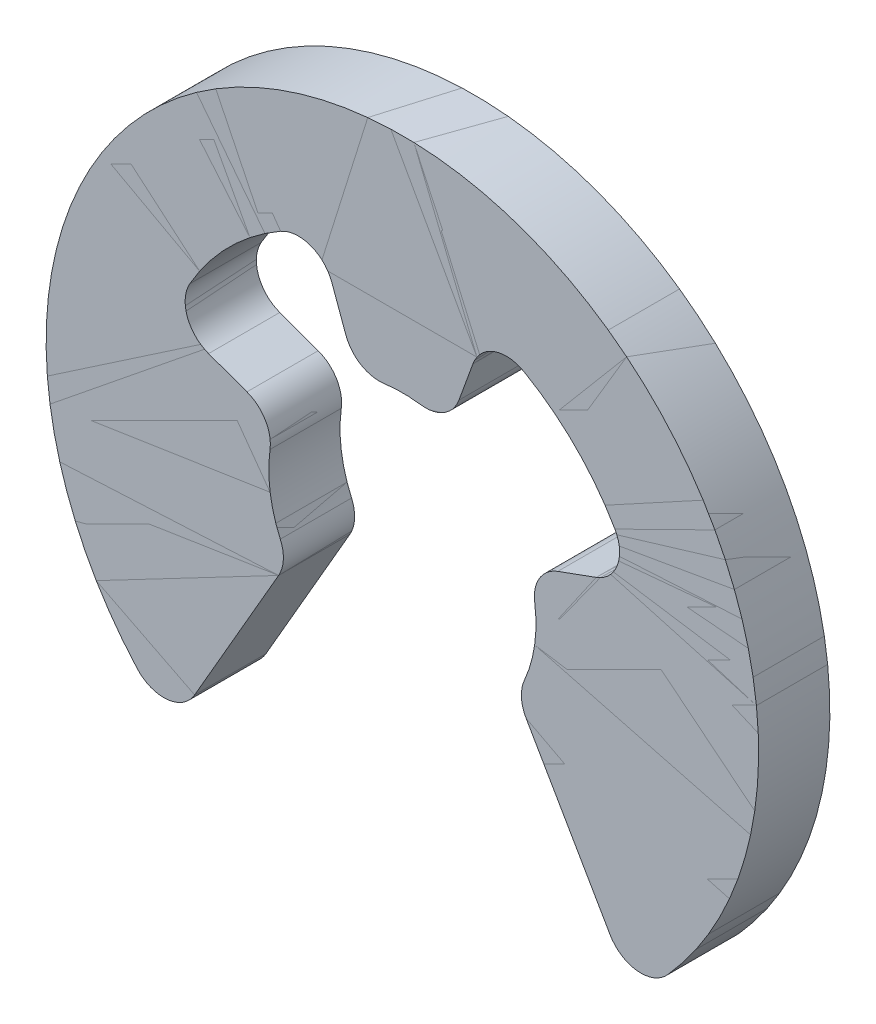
ISO-10303-21;
HEADER;
FILE_DESCRIPTION(('STEP AP214'),'2;1');
FILE_NAME('part.step','',(''),(''),'','','');
FILE_SCHEMA(('AUTOMOTIVE_DESIGN { 1 0 10303 214 1 1 1 1 }'));
ENDSEC;
DATA;
#1=APPLICATION_CONTEXT('core data for automotive mechanical design processes');
#2=APPLICATION_PROTOCOL_DEFINITION('international standard','automotive_design',2000,#1);
#3=PRODUCT_CONTEXT('',#1,'mechanical');
#4=PRODUCT('Part','Part','',(#3));
#5=PRODUCT_RELATED_PRODUCT_CATEGORY('part','',(#4));
#6=PRODUCT_DEFINITION_FORMATION('','',#4);
#7=PRODUCT_DEFINITION_CONTEXT('part definition',#1,'design');
#8=PRODUCT_DEFINITION('design','',#6,#7);
#9=PRODUCT_DEFINITION_SHAPE('','',#8);
#10=(LENGTH_UNIT() NAMED_UNIT(*) SI_UNIT(.MILLI.,.METRE.));
#11=(NAMED_UNIT(*) PLANE_ANGLE_UNIT() SI_UNIT($,.RADIAN.));
#12=(NAMED_UNIT(*) SI_UNIT($,.STERADIAN.) SOLID_ANGLE_UNIT());
#13=UNCERTAINTY_MEASURE_WITH_UNIT(LENGTH_MEASURE(1.E-05),#10,'distance_accuracy_value','');
#14=(GEOMETRIC_REPRESENTATION_CONTEXT(3) GLOBAL_UNCERTAINTY_ASSIGNED_CONTEXT((#13)) GLOBAL_UNIT_ASSIGNED_CONTEXT((#10,
#11,#12)) REPRESENTATION_CONTEXT('',''));
#15=CARTESIAN_POINT('',(0.,0.,0.));
#16=DIRECTION('',(0.,0.,1.));
#17=DIRECTION('',(1.,0.,0.));
#18=AXIS2_PLACEMENT_3D('',#15,#16,#17);
#19=CARTESIAN_POINT('',(2.13722457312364,-1.15020983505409,-0.4));
#20=DIRECTION('',(0.,0.,-1.));
#21=DIRECTION('',(-1.,0.,0.));
#22=AXIS2_PLACEMENT_3D('',#19,#20,#21);
#23=PLANE('',#22);
#24=DIRECTION('',(0.499999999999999,-0.866025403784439,0.));
#25=VECTOR('',#24,1.);
#26=CARTESIAN_POINT('',(0.290530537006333,-0.50321365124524,-0.4));
#27=LINE('',#26,#25);
#28=CARTESIAN_POINT('',(0.0548380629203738,-0.0949823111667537,-0.4));
#29=VERTEX_POINT('',#28);
#30=CARTESIAN_POINT('',(0.526223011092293,-0.911444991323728,-0.4));
#31=VERTEX_POINT('',#30);
#32=EDGE_CURVE('P0_E591',#29,#31,#27,.T.);
#33=ORIENTED_EDGE('',*,*,#32,.F.);
#34=CARTESIAN_POINT('',(0.22804314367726,0.0050176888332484,-0.4));
#35=DIRECTION('',(0.,0.,-1.));
#36=DIRECTION('',(-1.,0.,0.));
#37=AXIS2_PLACEMENT_3D('',#34,#35,#36);
#38=CIRCLE('',#37,0.200000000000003);
#39=CARTESIAN_POINT('',(0.0452972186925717,0.0862822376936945,-0.4));
#40=VERTEX_POINT('',#39);
#41=EDGE_CURVE('P0_E517',#29,#40,#38,.T.);
#42=ORIENTED_EDGE('',*,*,#41,.T.);
#43=CARTESIAN_POINT('',(-0.64,0.39102429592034,-0.4));
#44=DIRECTION('',(0.,0.,-1.));
#45=DIRECTION('',(-1.,0.,0.));
#46=AXIS2_PLACEMENT_3D('',#43,#44,#45);
#47=CIRCLE('',#46,0.750000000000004);
#48=CARTESIAN_POINT('',(0.102977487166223,0.493417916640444,-0.4));
#49=VERTEX_POINT('',#48);
#50=EDGE_CURVE('P0_E510',#49,#40,#47,.T.);
#51=ORIENTED_EDGE('',*,*,#50,.F.);
#52=CARTESIAN_POINT('',(0.30110481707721,0.5207228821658,-0.4));
#53=DIRECTION('',(0.,0.,-1.));
#54=DIRECTION('',(-1.,0.,0.));
#55=AXIS2_PLACEMENT_3D('',#52,#53,#54);
#56=CIRCLE('',#55,0.199999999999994);
#57=CARTESIAN_POINT('',(0.232700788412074,0.708661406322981,-0.4));
#58=VERTEX_POINT('',#57);
#59=EDGE_CURVE('P0_E514',#49,#58,#56,.T.);
#60=ORIENTED_EDGE('',*,*,#59,.T.);
#61=DIRECTION('',(-0.939692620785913,-0.342020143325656,0.));
#62=VECTOR('',#61,1.);
#63=CARTESIAN_POINT('',(0.260087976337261,0.71862952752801,-0.4));
#64=LINE('',#63,#62);
#65=CARTESIAN_POINT('',(0.44802650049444,0.78703355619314,-0.4));
#66=VERTEX_POINT('',#65);
#67=EDGE_CURVE('P0_E528',#66,#58,#64,.T.);
#68=ORIENTED_EDGE('',*,*,#67,.F.);
#69=CARTESIAN_POINT('',(0.37962247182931,0.97497208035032,-0.4));
#70=DIRECTION('',(0.,0.,-1.));
#71=DIRECTION('',(-1.,0.,0.));
#72=AXIS2_PLACEMENT_3D('',#69,#70,#71);
#73=CIRCLE('',#72,0.20000000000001);
#74=CARTESIAN_POINT('',(0.553175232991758,1.07436744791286,-0.4));
#75=VERTEX_POINT('',#74);
#76=EDGE_CURVE('P0_E536',#75,#66,#73,.T.);
#77=ORIENTED_EDGE('',*,*,#76,.F.);
#78=CARTESIAN_POINT('',(-0.64,0.39102429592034,-0.4));
#79=DIRECTION('',(0.,0.,-1.));
#80=DIRECTION('',(-1.,0.,0.));
#81=AXIS2_PLACEMENT_3D('',#78,#79,#80);
#82=CIRCLE('',#81,1.375);
#83=CARTESIAN_POINT('',(0.0433431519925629,1.58419952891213,-0.4));
#84=VERTEX_POINT('',#83);
#85=EDGE_CURVE('P0_E540',#84,#75,#82,.T.);
#86=ORIENTED_EDGE('',*,*,#85,.F.);
#87=CARTESIAN_POINT('',(-0.05605221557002,1.4106467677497,-0.4));
#88=DIRECTION('',(0.,0.,-1.));
#89=DIRECTION('',(-1.,0.,0.));
#90=AXIS2_PLACEMENT_3D('',#87,#88,#89);
#91=CIRCLE('',#90,0.200000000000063);
#92=CARTESIAN_POINT('',(-0.243990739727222,1.47905079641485,-0.4));
#93=VERTEX_POINT('',#92);
#94=EDGE_CURVE('P0_E543',#93,#84,#91,.T.);
#95=ORIENTED_EDGE('',*,*,#94,.F.);
#96=DIRECTION('',(0.342020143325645,0.939692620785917,0.));
#97=VECTOR('',#96,1.);
#98=CARTESIAN_POINT('',(-0.253958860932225,1.4516636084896,-0.4));
#99=LINE('',#98,#97);
#100=CARTESIAN_POINT('',(-0.322362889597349,1.26372508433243,-0.4));
#101=VERTEX_POINT('',#100);
#102=EDGE_CURVE('P0_E596',#101,#93,#99,.T.);
#103=ORIENTED_EDGE('',*,*,#102,.F.);
#104=CARTESIAN_POINT('',(-0.51030141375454,1.3321291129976,-0.4));
#105=DIRECTION('',(0.,0.,-1.));
#106=DIRECTION('',(-1.,0.,0.));
#107=AXIS2_PLACEMENT_3D('',#104,#105,#106);
#108=CIRCLE('',#107,0.199999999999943);
#109=CARTESIAN_POINT('',(-0.537606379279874,1.13400178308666,-0.4));
#110=VERTEX_POINT('',#109);
#111=EDGE_CURVE('P0_E546',#101,#110,#108,.T.);
#112=ORIENTED_EDGE('',*,*,#111,.T.);
#113=CARTESIAN_POINT('',(-0.64,0.39102429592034,-0.4));
#114=DIRECTION('',(0.,0.,-1.));
#115=DIRECTION('',(-1.,0.,0.));
#116=AXIS2_PLACEMENT_3D('',#113,#114,#115);
#117=CIRCLE('',#116,0.750000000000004);
#118=CARTESIAN_POINT('',(-0.742393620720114,1.13400178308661,-0.4));
#119=VERTEX_POINT('',#118);
#120=EDGE_CURVE('P0_E549',#119,#110,#117,.T.);
#121=ORIENTED_EDGE('',*,*,#120,.F.);
#122=CARTESIAN_POINT('',(-0.76969858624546,1.3321291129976,-0.4));
#123=DIRECTION('',(0.,0.,-1.));
#124=DIRECTION('',(-1.,0.,0.));
#125=AXIS2_PLACEMENT_3D('',#122,#123,#124);
#126=CIRCLE('',#125,0.199999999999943);
#127=CARTESIAN_POINT('',(-0.957637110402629,1.26372508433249,-0.4));
#128=VERTEX_POINT('',#127);
#129=EDGE_CURVE('P0_E553',#119,#128,#126,.T.);
#130=ORIENTED_EDGE('',*,*,#129,.T.);
#131=DIRECTION('',(0.342020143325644,-0.939692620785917,0.));
#132=VECTOR('',#131,1.);
#133=CARTESIAN_POINT('',(-0.967605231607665,1.2911122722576,-0.4));
#134=LINE('',#133,#132);
#135=CARTESIAN_POINT('',(-1.03600926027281,1.47905079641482,-0.4));
#136=VERTEX_POINT('',#135);
#137=EDGE_CURVE('P0_E556',#136,#128,#134,.T.);
#138=ORIENTED_EDGE('',*,*,#137,.F.);
#139=CARTESIAN_POINT('',(-1.22394778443,1.4106467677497,-0.4));
#140=DIRECTION('',(0.,0.,-1.));
#141=DIRECTION('',(-1.,0.,0.));
#142=AXIS2_PLACEMENT_3D('',#139,#140,#141);
#143=CIRCLE('',#142,0.200000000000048);
#144=CARTESIAN_POINT('',(-1.32334315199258,1.58419952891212,-0.4));
#145=VERTEX_POINT('',#144);
#146=EDGE_CURVE('P0_E557',#145,#136,#143,.T.);
#147=ORIENTED_EDGE('',*,*,#146,.F.);
#148=CARTESIAN_POINT('',(-0.64,0.39102429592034,-0.4));
#149=DIRECTION('',(0.,0.,-1.));
#150=DIRECTION('',(-1.,0.,0.));
#151=AXIS2_PLACEMENT_3D('',#148,#149,#150);
#152=CIRCLE('',#151,1.375);
#153=CARTESIAN_POINT('',(-1.83317523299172,1.07436744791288,-0.4));
#154=VERTEX_POINT('',#153);
#155=EDGE_CURVE('P0_E561',#154,#145,#152,.T.);
#156=ORIENTED_EDGE('',*,*,#155,.F.);
#157=CARTESIAN_POINT('',(-1.6596224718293,0.97497208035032,-0.4));
#158=DIRECTION('',(0.,0.,-1.));
#159=DIRECTION('',(-1.,0.,0.));
#160=AXIS2_PLACEMENT_3D('',#157,#158,#159);
#161=CIRCLE('',#160,0.199999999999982);
#162=CARTESIAN_POINT('',(-1.72802650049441,0.787033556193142,-0.4));
#163=VERTEX_POINT('',#162);
#164=EDGE_CURVE('P0_E564',#163,#154,#161,.T.);
#165=ORIENTED_EDGE('',*,*,#164,.F.);
#166=DIRECTION('',(-0.939692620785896,0.342020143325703,0.));
#167=VECTOR('',#166,1.);
#168=CARTESIAN_POINT('',(-1.70063931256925,0.77706543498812,-0.4));
#169=LINE('',#168,#167);
#170=CARTESIAN_POINT('',(-1.51270078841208,0.708661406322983,-0.4));
#171=VERTEX_POINT('',#170);
#172=EDGE_CURVE('P0_E601',#171,#163,#169,.T.);
#173=ORIENTED_EDGE('',*,*,#172,.F.);
#174=CARTESIAN_POINT('',(-1.5811048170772,0.5207228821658,-0.4));
#175=DIRECTION('',(0.,0.,-1.));
#176=DIRECTION('',(-1.,0.,0.));
#177=AXIS2_PLACEMENT_3D('',#174,#175,#176);
#178=CIRCLE('',#177,0.200000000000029);
#179=CARTESIAN_POINT('',(-1.38297748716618,0.493417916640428,-0.4));
#180=VERTEX_POINT('',#179);
#181=EDGE_CURVE('P0_E567',#171,#180,#178,.T.);
#182=ORIENTED_EDGE('',*,*,#181,.T.);
#183=CARTESIAN_POINT('',(-0.64,0.39102429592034,-0.4));
#184=DIRECTION('',(0.,0.,-1.));
#185=DIRECTION('',(-1.,0.,0.));
#186=AXIS2_PLACEMENT_3D('',#183,#184,#185);
#187=CIRCLE('',#186,0.750000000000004);
#188=CARTESIAN_POINT('',(-1.32529721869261,0.0862822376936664,-0.4));
#189=VERTEX_POINT('',#188);
#190=EDGE_CURVE('P0_E570',#189,#180,#187,.T.);
#191=ORIENTED_EDGE('',*,*,#190,.F.);
#192=CARTESIAN_POINT('',(-1.5080431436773,0.0050176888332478,-0.4));
#193=DIRECTION('',(0.,0.,-1.));
#194=DIRECTION('',(-1.,0.,0.));
#195=AXIS2_PLACEMENT_3D('',#192,#193,#194);
#196=CIRCLE('',#195,0.199999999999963);
#197=CARTESIAN_POINT('',(-1.33483806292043,-0.094982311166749,-0.4));
#198=VERTEX_POINT('',#197);
#199=EDGE_CURVE('P0_E574',#189,#198,#196,.T.);
#200=ORIENTED_EDGE('',*,*,#199,.T.);
#201=DIRECTION('',(0.499999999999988,0.866025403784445,0.));
#202=VECTOR('',#201,1.);
#203=CARTESIAN_POINT('',(-1.57053053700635,-0.503213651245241,-0.4));
#204=LINE('',#203,#202);
#205=CARTESIAN_POINT('',(-1.8062230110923,-0.911444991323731,-0.4));
#206=VERTEX_POINT('',#205);
#207=EDGE_CURVE('P0_E577',#206,#198,#204,.T.);
#208=ORIENTED_EDGE('',*,*,#207,.F.);
#209=CARTESIAN_POINT('',(-1.9794280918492,-0.81144499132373,-0.4));
#210=DIRECTION('',(0.,0.,-1.));
#211=DIRECTION('',(-1.,0.,0.));
#212=AXIS2_PLACEMENT_3D('',#209,#210,#211);
#213=CIRCLE('',#212,0.200000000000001);
#214=CARTESIAN_POINT('',(-2.12825343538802,-0.945052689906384,-0.4));
#215=VERTEX_POINT('',#214);
#216=EDGE_CURVE('P0_E578',#206,#215,#213,.T.);
#217=ORIENTED_EDGE('',*,*,#216,.T.);
#218=CARTESIAN_POINT('',(-0.64,0.39102429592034,-0.4));
#219=DIRECTION('',(0.,0.,1.));
#220=DIRECTION('',(1.,0.,0.));
#221=AXIS2_PLACEMENT_3D('',#218,#219,#220);
#222=CIRCLE('',#221,2.00000000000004);
#223=CARTESIAN_POINT('',(0.84825343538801,-0.94505268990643,-0.4));
#224=VERTEX_POINT('',#223);
#225=EDGE_CURVE('P0_E581',#215,#224,#222,.F.);
#226=ORIENTED_EDGE('',*,*,#225,.T.);
#227=CARTESIAN_POINT('',(0.69942809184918,-0.81144499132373,-0.4));
#228=DIRECTION('',(0.,0.,-1.));
#229=DIRECTION('',(-1.,0.,0.));
#230=AXIS2_PLACEMENT_3D('',#227,#228,#229);
#231=CIRCLE('',#230,0.199999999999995);
#232=EDGE_CURVE('P0_E356',#224,#31,#231,.T.);
#233=ORIENTED_EDGE('',*,*,#232,.T.);
#234=EDGE_LOOP('',(#33,#42,#51,#60,#68,#77,#86,#95,#103,#112,#121,#130,#138,#147,#156,#165,#173,
#182,#191,#200,#208,#217,#226,#233));
#235=FACE_BOUND('',#234,.T.);
#236=ADVANCED_FACE('P0_F352',(#235),#23,.T.);
#237=CARTESIAN_POINT('',(0.054838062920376,-0.094982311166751,0.));
#238=DIRECTION('',(-0.866025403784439,-0.499999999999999,0.));
#239=DIRECTION('',(0.,0.,-1.));
#240=AXIS2_PLACEMENT_3D('',#237,#238,#239);
#241=PLANE('',#240);
#242=ORIENTED_EDGE('',*,*,#32,.T.);
#243=DIRECTION('',(0.,0.,1.));
#244=VECTOR('',#243,1.);
#245=CARTESIAN_POINT('',(0.526223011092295,-0.911444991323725,-0.2));
#246=LINE('',#245,#244);
#247=CARTESIAN_POINT('',(0.526223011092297,-0.911444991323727,0.));
#248=VERTEX_POINT('',#247);
#249=EDGE_CURVE('P0_E582',#31,#248,#246,.T.);
#250=ORIENTED_EDGE('',*,*,#249,.T.);
#251=DIRECTION('',(0.500000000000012,-0.866025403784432,0.));
#252=VECTOR('',#251,1.);
#253=CARTESIAN_POINT('',(0.054838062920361,-0.0949823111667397,0.));
#254=LINE('',#253,#252);
#255=CARTESIAN_POINT('',(0.0548380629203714,-0.0949823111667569,0.));
#256=VERTEX_POINT('',#255);
#257=EDGE_CURVE('P0_E670',#256,#248,#254,.T.);
#258=ORIENTED_EDGE('',*,*,#257,.F.);
#259=DIRECTION('',(0.,0.,-1.));
#260=VECTOR('',#259,1.);
#261=CARTESIAN_POINT('',(0.0548380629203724,-0.0949823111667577,-0.2));
#262=LINE('',#261,#260);
#263=EDGE_CURVE('P0_E518',#256,#29,#262,.T.);
#264=ORIENTED_EDGE('',*,*,#263,.T.);
#265=EDGE_LOOP('',(#242,#250,#258,#264));
#266=FACE_BOUND('',#265,.T.);
#267=ADVANCED_FACE('P0_F718',(#266),#241,.T.);
#268=CARTESIAN_POINT('',(0.69942809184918,-0.81144499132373,0.));
#269=DIRECTION('',(0.,0.,-1.));
#270=DIRECTION('',(-1.,0.,0.));
#271=AXIS2_PLACEMENT_3D('',#268,#269,#270);
#272=CYLINDRICAL_SURFACE('',#271,0.199999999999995);
#273=CARTESIAN_POINT('',(0.69942809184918,-0.81144499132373,0.));
#274=DIRECTION('',(0.,0.,-1.));
#275=DIRECTION('',(-1.,0.,0.));
#276=AXIS2_PLACEMENT_3D('',#273,#274,#275);
#277=CIRCLE('',#276,0.199999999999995);
#278=CARTESIAN_POINT('',(0.84825343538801,-0.94505268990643,0.));
#279=VERTEX_POINT('',#278);
#280=EDGE_CURVE('P0_E667',#248,#279,#277,.F.);
#281=ORIENTED_EDGE('',*,*,#280,.F.);
#282=ORIENTED_EDGE('',*,*,#249,.F.);
#283=ORIENTED_EDGE('',*,*,#232,.F.);
#284=DIRECTION('',(0.,0.,1.));
#285=VECTOR('',#284,1.);
#286=CARTESIAN_POINT('',(0.848253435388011,-0.945052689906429,-0.2));
#287=LINE('',#286,#285);
#288=EDGE_CURVE('P0_E580',#224,#279,#287,.T.);
#289=ORIENTED_EDGE('',*,*,#288,.T.);
#290=EDGE_LOOP('',(#281,#282,#283,#289));
#291=FACE_BOUND('',#290,.T.);
#292=ADVANCED_FACE('P0_F717',(#291),#272,.T.);
#293=CARTESIAN_POINT('',(-0.64,0.39102429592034,-0.4));
#294=DIRECTION('',(0.,0.,1.));
#295=DIRECTION('',(1.,0.,0.));
#296=AXIS2_PLACEMENT_3D('',#293,#294,#295);
#297=CYLINDRICAL_SURFACE('',#296,2.00000000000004);
#298=ORIENTED_EDGE('',*,*,#288,.F.);
#299=ORIENTED_EDGE('',*,*,#225,.F.);
#300=DIRECTION('',(0.,0.,1.));
#301=VECTOR('',#300,1.);
#302=CARTESIAN_POINT('',(-2.12825343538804,-0.945052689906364,-0.2));
#303=LINE('',#302,#301);
#304=CARTESIAN_POINT('',(-2.12825343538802,-0.945052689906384,0.));
#305=VERTEX_POINT('',#304);
#306=EDGE_CURVE('P0_E579',#215,#305,#303,.T.);
#307=ORIENTED_EDGE('',*,*,#306,.T.);
#308=CARTESIAN_POINT('',(-0.64,0.39102429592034,0.));
#309=DIRECTION('',(0.,0.,1.));
#310=DIRECTION('',(1.,0.,0.));
#311=AXIS2_PLACEMENT_3D('',#308,#309,#310);
#312=CIRCLE('',#311,2.00000000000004);
#313=EDGE_CURVE('P0_E664',#279,#305,#312,.T.);
#314=ORIENTED_EDGE('',*,*,#313,.F.);
#315=EDGE_LOOP('',(#298,#299,#307,#314));
#316=FACE_BOUND('',#315,.T.);
#317=ADVANCED_FACE('P0_F711',(#316),#297,.T.);
#318=CARTESIAN_POINT('',(-1.9794280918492,-0.81144499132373,0.));
#319=DIRECTION('',(0.,0.,-1.));
#320=DIRECTION('',(-1.,0.,0.));
#321=AXIS2_PLACEMENT_3D('',#318,#319,#320);
#322=CYLINDRICAL_SURFACE('',#321,0.200000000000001);
#323=CARTESIAN_POINT('',(-1.9794280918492,-0.81144499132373,0.));
#324=DIRECTION('',(0.,0.,-1.));
#325=DIRECTION('',(-1.,0.,0.));
#326=AXIS2_PLACEMENT_3D('',#323,#324,#325);
#327=CIRCLE('',#326,0.200000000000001);
#328=CARTESIAN_POINT('',(-1.8062230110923,-0.911444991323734,0.));
#329=VERTEX_POINT('',#328);
#330=EDGE_CURVE('P0_E661',#305,#329,#327,.F.);
#331=ORIENTED_EDGE('',*,*,#330,.F.);
#332=ORIENTED_EDGE('',*,*,#306,.F.);
#333=ORIENTED_EDGE('',*,*,#216,.F.);
#334=DIRECTION('',(0.,0.,-1.));
#335=VECTOR('',#334,1.);
#336=CARTESIAN_POINT('',(-1.8062230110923,-0.91144499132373,-0.471384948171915));
#337=LINE('',#336,#335);
#338=EDGE_CURVE('P0_E605',#329,#206,#337,.T.);
#339=ORIENTED_EDGE('',*,*,#338,.F.);
#340=EDGE_LOOP('',(#331,#332,#333,#339));
#341=FACE_BOUND('',#340,.T.);
#342=ADVANCED_FACE('P0_F713',(#341),#322,.T.);
#343=CARTESIAN_POINT('',(-1.8062230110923,-0.91144499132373,0.));
#344=DIRECTION('',(0.866025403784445,-0.499999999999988,0.));
#345=DIRECTION('',(0.,0.,-1.));
#346=AXIS2_PLACEMENT_3D('',#343,#344,#345);
#347=PLANE('',#346);
#348=ORIENTED_EDGE('',*,*,#207,.T.);
#349=DIRECTION('',(0.,0.,1.));
#350=VECTOR('',#349,1.);
#351=CARTESIAN_POINT('',(-1.33483806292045,-0.094982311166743,-0.2));
#352=LINE('',#351,#350);
#353=CARTESIAN_POINT('',(-1.33483806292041,-0.0949823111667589,0.));
#354=VERTEX_POINT('',#353);
#355=EDGE_CURVE('P0_E576',#198,#354,#352,.T.);
#356=ORIENTED_EDGE('',*,*,#355,.T.);
#357=DIRECTION('',(0.500000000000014,0.86602540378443,0.));
#358=VECTOR('',#357,1.);
#359=CARTESIAN_POINT('',(-1.80622301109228,-0.911444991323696,0.));
#360=LINE('',#359,#358);
#361=EDGE_CURVE('P0_E658',#329,#354,#360,.T.);
#362=ORIENTED_EDGE('',*,*,#361,.F.);
#363=ORIENTED_EDGE('',*,*,#338,.T.);
#364=EDGE_LOOP('',(#348,#356,#362,#363));
#365=FACE_BOUND('',#364,.T.);
#366=ADVANCED_FACE('P0_F793',(#365),#347,.T.);
#367=CARTESIAN_POINT('',(-1.5080431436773,0.0050176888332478,0.));
#368=DIRECTION('',(0.,0.,-1.));
#369=DIRECTION('',(-1.,0.,0.));
#370=AXIS2_PLACEMENT_3D('',#367,#368,#369);
#371=CYLINDRICAL_SURFACE('',#370,0.199999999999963);
#372=ORIENTED_EDGE('',*,*,#199,.F.);
#373=DIRECTION('',(0.,0.,-1.));
#374=VECTOR('',#373,1.);
#375=CARTESIAN_POINT('',(-1.32529721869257,0.0862822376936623,-0.2));
#376=LINE('',#375,#374);
#377=CARTESIAN_POINT('',(-1.32529721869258,0.0862822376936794,0.));
#378=VERTEX_POINT('',#377);
#379=EDGE_CURVE('P0_E573',#378,#189,#376,.T.);
#380=ORIENTED_EDGE('',*,*,#379,.F.);
#381=CARTESIAN_POINT('',(-1.5080431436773,0.0050176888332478,0.));
#382=DIRECTION('',(0.,0.,-1.));
#383=DIRECTION('',(-1.,0.,0.));
#384=AXIS2_PLACEMENT_3D('',#381,#382,#383);
#385=CIRCLE('',#384,0.199999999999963);
#386=EDGE_CURVE('P0_E655',#354,#378,#385,.F.);
#387=ORIENTED_EDGE('',*,*,#386,.F.);
#388=ORIENTED_EDGE('',*,*,#355,.F.);
#389=EDGE_LOOP('',(#372,#380,#387,#388));
#390=FACE_BOUND('',#389,.T.);
#391=ADVANCED_FACE('P0_F789',(#390),#371,.T.);
#392=CARTESIAN_POINT('',(-0.64,0.39102429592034,0.));
#393=DIRECTION('',(0.,0.,-1.));
#394=DIRECTION('',(-1.,0.,0.));
#395=AXIS2_PLACEMENT_3D('',#392,#393,#394);
#396=CYLINDRICAL_SURFACE('',#395,0.750000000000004);
#397=ORIENTED_EDGE('',*,*,#190,.T.);
#398=DIRECTION('',(0.,0.,1.));
#399=VECTOR('',#398,1.);
#400=CARTESIAN_POINT('',(-1.38297748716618,0.493417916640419,-0.2));
#401=LINE('',#400,#399);
#402=CARTESIAN_POINT('',(-1.38297748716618,0.493417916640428,0.));
#403=VERTEX_POINT('',#402);
#404=EDGE_CURVE('P0_E569',#180,#403,#401,.T.);
#405=ORIENTED_EDGE('',*,*,#404,.T.);
#406=CARTESIAN_POINT('',(-0.64,0.39102429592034,0.));
#407=DIRECTION('',(0.,0.,-1.));
#408=DIRECTION('',(-1.,0.,0.));
#409=AXIS2_PLACEMENT_3D('',#406,#407,#408);
#410=CIRCLE('',#409,0.750000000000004);
#411=EDGE_CURVE('P0_E652',#378,#403,#410,.T.);
#412=ORIENTED_EDGE('',*,*,#411,.F.);
#413=ORIENTED_EDGE('',*,*,#379,.T.);
#414=EDGE_LOOP('',(#397,#405,#412,#413));
#415=FACE_BOUND('',#414,.T.);
#416=ADVANCED_FACE('P0_F785',(#415),#396,.F.);
#417=CARTESIAN_POINT('',(-1.5811048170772,0.5207228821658,0.));
#418=DIRECTION('',(0.,0.,-1.));
#419=DIRECTION('',(-1.,0.,0.));
#420=AXIS2_PLACEMENT_3D('',#417,#418,#419);
#421=CYLINDRICAL_SURFACE('',#420,0.200000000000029);
#422=ORIENTED_EDGE('',*,*,#181,.F.);
#423=DIRECTION('',(0.,0.,-1.));
#424=VECTOR('',#423,1.);
#425=CARTESIAN_POINT('',(-1.5127007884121,0.70866140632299,-0.2));
#426=LINE('',#425,#424);
#427=CARTESIAN_POINT('',(-1.51270078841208,0.708661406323,0.));
#428=VERTEX_POINT('',#427);
#429=EDGE_CURVE('P0_E603',#428,#171,#426,.T.);
#430=ORIENTED_EDGE('',*,*,#429,.F.);
#431=CARTESIAN_POINT('',(-1.5811048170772,0.5207228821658,0.));
#432=DIRECTION('',(0.,0.,-1.));
#433=DIRECTION('',(-1.,0.,0.));
#434=AXIS2_PLACEMENT_3D('',#431,#432,#433);
#435=CIRCLE('',#434,0.200000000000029);
#436=EDGE_CURVE('P0_E649',#403,#428,#435,.F.);
#437=ORIENTED_EDGE('',*,*,#436,.F.);
#438=ORIENTED_EDGE('',*,*,#404,.F.);
#439=EDGE_LOOP('',(#422,#430,#437,#438));
#440=FACE_BOUND('',#439,.T.);
#441=ADVANCED_FACE('P0_F782',(#440),#421,.T.);
#442=CARTESIAN_POINT('',(-1.5127007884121,0.70866140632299,0.));
#443=DIRECTION('',(0.342020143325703,0.939692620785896,0.));
#444=DIRECTION('',(0.,0.,-1.));
#445=AXIS2_PLACEMENT_3D('',#442,#443,#444);
#446=PLANE('',#445);
#447=ORIENTED_EDGE('',*,*,#172,.T.);
#448=DIRECTION('',(0.,0.,-1.));
#449=VECTOR('',#448,1.);
#450=CARTESIAN_POINT('',(-1.72802650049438,0.787033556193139,-0.2));
#451=LINE('',#450,#449);
#452=CARTESIAN_POINT('',(-1.7280265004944,0.787033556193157,0.));
#453=VERTEX_POINT('',#452);
#454=EDGE_CURVE('P0_E566',#453,#163,#451,.T.);
#455=ORIENTED_EDGE('',*,*,#454,.F.);
#456=DIRECTION('',(-0.939692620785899,0.342020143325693,0.));
#457=VECTOR('',#456,1.);
#458=CARTESIAN_POINT('',(-1.51270078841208,0.708661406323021,0.));
#459=LINE('',#458,#457);
#460=EDGE_CURVE('P0_E646',#428,#453,#459,.T.);
#461=ORIENTED_EDGE('',*,*,#460,.F.);
#462=ORIENTED_EDGE('',*,*,#429,.T.);
#463=EDGE_LOOP('',(#447,#455,#461,#462));
#464=FACE_BOUND('',#463,.T.);
#465=ADVANCED_FACE('P0_F780',(#464),#446,.T.);
#466=CARTESIAN_POINT('',(-1.6596224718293,0.97497208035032,0.));
#467=DIRECTION('',(0.,0.,-1.));
#468=DIRECTION('',(-1.,0.,0.));
#469=AXIS2_PLACEMENT_3D('',#466,#467,#468);
#470=CYLINDRICAL_SURFACE('',#469,0.199999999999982);
#471=ORIENTED_EDGE('',*,*,#454,.T.);
#472=ORIENTED_EDGE('',*,*,#164,.T.);
#473=DIRECTION('',(0.,0.,-1.));
#474=VECTOR('',#473,1.);
#475=CARTESIAN_POINT('',(-1.83317523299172,1.07436744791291,-0.2));
#476=LINE('',#475,#474);
#477=CARTESIAN_POINT('',(-1.83317523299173,1.07436744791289,0.));
#478=VERTEX_POINT('',#477);
#479=EDGE_CURVE('P0_E563',#478,#154,#476,.T.);
#480=ORIENTED_EDGE('',*,*,#479,.F.);
#481=CARTESIAN_POINT('',(-1.6596224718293,0.97497208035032,0.));
#482=DIRECTION('',(0.,0.,-1.));
#483=DIRECTION('',(-1.,0.,0.));
#484=AXIS2_PLACEMENT_3D('',#481,#482,#483);
#485=CIRCLE('',#484,0.199999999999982);
#486=EDGE_CURVE('P0_E643',#453,#478,#485,.T.);
#487=ORIENTED_EDGE('',*,*,#486,.F.);
#488=EDGE_LOOP('',(#471,#472,#480,#487));
#489=FACE_BOUND('',#488,.T.);
#490=ADVANCED_FACE('P0_F776',(#489),#470,.F.);
#491=CARTESIAN_POINT('',(-0.64,0.39102429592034,0.));
#492=DIRECTION('',(0.,0.,-1.));
#493=DIRECTION('',(-1.,0.,0.));
#494=AXIS2_PLACEMENT_3D('',#491,#492,#493);
#495=CYLINDRICAL_SURFACE('',#494,1.375);
#496=ORIENTED_EDGE('',*,*,#155,.T.);
#497=DIRECTION('',(0.,0.,-1.));
#498=VECTOR('',#497,1.);
#499=CARTESIAN_POINT('',(-1.32334315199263,1.58419952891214,-0.2));
#500=LINE('',#499,#498);
#501=CARTESIAN_POINT('',(-1.3233431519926,1.58419952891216,0.));
#502=VERTEX_POINT('',#501);
#503=EDGE_CURVE('P0_E560',#502,#145,#500,.T.);
#504=ORIENTED_EDGE('',*,*,#503,.F.);
#505=CARTESIAN_POINT('',(-0.64,0.39102429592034,0.));
#506=DIRECTION('',(0.,0.,-1.));
#507=DIRECTION('',(-1.,0.,0.));
#508=AXIS2_PLACEMENT_3D('',#505,#506,#507);
#509=CIRCLE('',#508,1.375);
#510=EDGE_CURVE('P0_E640',#478,#502,#509,.T.);
#511=ORIENTED_EDGE('',*,*,#510,.F.);
#512=ORIENTED_EDGE('',*,*,#479,.T.);
#513=EDGE_LOOP('',(#496,#504,#511,#512));
#514=FACE_BOUND('',#513,.T.);
#515=ADVANCED_FACE('P0_F772',(#514),#495,.F.);
#516=CARTESIAN_POINT('',(-1.22394778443,1.4106467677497,0.));
#517=DIRECTION('',(0.,0.,-1.));
#518=DIRECTION('',(-1.,0.,0.));
#519=AXIS2_PLACEMENT_3D('',#516,#517,#518);
#520=CYLINDRICAL_SURFACE('',#519,0.200000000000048);
#521=ORIENTED_EDGE('',*,*,#503,.T.);
#522=ORIENTED_EDGE('',*,*,#146,.T.);
#523=DIRECTION('',(0.,0.,-1.));
#524=VECTOR('',#523,1.);
#525=CARTESIAN_POINT('',(-1.0360092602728,1.4790507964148,-0.2));
#526=LINE('',#525,#524);
#527=CARTESIAN_POINT('',(-1.0360092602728,1.47905079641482,0.));
#528=VERTEX_POINT('',#527);
#529=EDGE_CURVE('P0_E559',#528,#136,#526,.T.);
#530=ORIENTED_EDGE('',*,*,#529,.F.);
#531=CARTESIAN_POINT('',(-1.22394778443,1.4106467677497,0.));
#532=DIRECTION('',(0.,0.,-1.));
#533=DIRECTION('',(-1.,0.,0.));
#534=AXIS2_PLACEMENT_3D('',#531,#532,#533);
#535=CIRCLE('',#534,0.200000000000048);
#536=EDGE_CURVE('P0_E637',#502,#528,#535,.T.);
#537=ORIENTED_EDGE('',*,*,#536,.F.);
#538=EDGE_LOOP('',(#521,#522,#530,#537));
#539=FACE_BOUND('',#538,.T.);
#540=ADVANCED_FACE('P0_F769',(#539),#520,.F.);
#541=CARTESIAN_POINT('',(-1.0360092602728,1.4790507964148,0.));
#542=DIRECTION('',(-0.939692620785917,-0.342020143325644,0.));
#543=DIRECTION('',(0.,0.,-1.));
#544=AXIS2_PLACEMENT_3D('',#541,#542,#543);
#545=PLANE('',#544);
#546=ORIENTED_EDGE('',*,*,#137,.T.);
#547=DIRECTION('',(0.,0.,1.));
#548=VECTOR('',#547,1.);
#549=CARTESIAN_POINT('',(-0.957637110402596,1.26372508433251,-0.2));
#550=LINE('',#549,#548);
#551=CARTESIAN_POINT('',(-0.957637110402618,1.26372508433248,0.));
#552=VERTEX_POINT('',#551);
#553=EDGE_CURVE('P0_E555',#128,#552,#550,.T.);
#554=ORIENTED_EDGE('',*,*,#553,.T.);
#555=DIRECTION('',(0.342020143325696,-0.939692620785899,0.));
#556=VECTOR('',#555,1.);
#557=CARTESIAN_POINT('',(-1.0360092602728,1.47905079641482,0.));
#558=LINE('',#557,#556);
#559=EDGE_CURVE('P0_E634',#528,#552,#558,.T.);
#560=ORIENTED_EDGE('',*,*,#559,.F.);
#561=ORIENTED_EDGE('',*,*,#529,.T.);
#562=EDGE_LOOP('',(#546,#554,#560,#561));
#563=FACE_BOUND('',#562,.T.);
#564=ADVANCED_FACE('P0_F767',(#563),#545,.T.);
#565=CARTESIAN_POINT('',(-0.76969858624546,1.3321291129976,0.));
#566=DIRECTION('',(0.,0.,-1.));
#567=DIRECTION('',(-1.,0.,0.));
#568=AXIS2_PLACEMENT_3D('',#565,#566,#567);
#569=CYLINDRICAL_SURFACE('',#568,0.199999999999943);
#570=ORIENTED_EDGE('',*,*,#129,.F.);
#571=DIRECTION('',(0.,0.,-1.));
#572=VECTOR('',#571,1.);
#573=CARTESIAN_POINT('',(-0.742393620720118,1.13400178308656,-0.2));
#574=LINE('',#573,#572);
#575=CARTESIAN_POINT('',(-0.742393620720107,1.13400178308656,0.));
#576=VERTEX_POINT('',#575);
#577=EDGE_CURVE('P0_E552',#576,#119,#574,.T.);
#578=ORIENTED_EDGE('',*,*,#577,.F.);
#579=CARTESIAN_POINT('',(-0.76969858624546,1.3321291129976,0.));
#580=DIRECTION('',(0.,0.,-1.));
#581=DIRECTION('',(-1.,0.,0.));
#582=AXIS2_PLACEMENT_3D('',#579,#580,#581);
#583=CIRCLE('',#582,0.199999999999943);
#584=EDGE_CURVE('P0_E631',#552,#576,#583,.F.);
#585=ORIENTED_EDGE('',*,*,#584,.F.);
#586=ORIENTED_EDGE('',*,*,#553,.F.);
#587=EDGE_LOOP('',(#570,#578,#585,#586));
#588=FACE_BOUND('',#587,.T.);
#589=ADVANCED_FACE('P0_F763',(#588),#569,.T.);
#590=CARTESIAN_POINT('',(-0.64,0.39102429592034,0.));
#591=DIRECTION('',(0.,0.,-1.));
#592=DIRECTION('',(-1.,0.,0.));
#593=AXIS2_PLACEMENT_3D('',#590,#591,#592);
#594=CYLINDRICAL_SURFACE('',#593,0.750000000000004);
#595=ORIENTED_EDGE('',*,*,#120,.T.);
#596=DIRECTION('',(0.,0.,1.));
#597=VECTOR('',#596,1.);
#598=CARTESIAN_POINT('',(-0.537606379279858,1.13400178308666,-0.2));
#599=LINE('',#598,#597);
#600=CARTESIAN_POINT('',(-0.537606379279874,1.13400178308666,0.));
#601=VERTEX_POINT('',#600);
#602=EDGE_CURVE('P0_E548',#110,#601,#599,.T.);
#603=ORIENTED_EDGE('',*,*,#602,.T.);
#604=CARTESIAN_POINT('',(-0.64,0.39102429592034,0.));
#605=DIRECTION('',(0.,0.,-1.));
#606=DIRECTION('',(-1.,0.,0.));
#607=AXIS2_PLACEMENT_3D('',#604,#605,#606);
#608=CIRCLE('',#607,0.750000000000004);
#609=EDGE_CURVE('P0_E628',#576,#601,#608,.T.);
#610=ORIENTED_EDGE('',*,*,#609,.F.);
#611=ORIENTED_EDGE('',*,*,#577,.T.);
#612=EDGE_LOOP('',(#595,#603,#610,#611));
#613=FACE_BOUND('',#612,.T.);
#614=ADVANCED_FACE('P0_F759',(#613),#594,.F.);
#615=CARTESIAN_POINT('',(-0.51030141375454,1.3321291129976,0.));
#616=DIRECTION('',(0.,0.,-1.));
#617=DIRECTION('',(-1.,0.,0.));
#618=AXIS2_PLACEMENT_3D('',#615,#616,#617);
#619=CYLINDRICAL_SURFACE('',#618,0.199999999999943);
#620=ORIENTED_EDGE('',*,*,#111,.F.);
#621=DIRECTION('',(0.,0.,-1.));
#622=VECTOR('',#621,1.);
#623=CARTESIAN_POINT('',(-0.32236288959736,1.2637250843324,-0.2));
#624=LINE('',#623,#622);
#625=CARTESIAN_POINT('',(-0.32236288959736,1.26372508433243,0.));
#626=VERTEX_POINT('',#625);
#627=EDGE_CURVE('P0_E598',#626,#101,#624,.T.);
#628=ORIENTED_EDGE('',*,*,#627,.F.);
#629=CARTESIAN_POINT('',(-0.51030141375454,1.3321291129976,0.));
#630=DIRECTION('',(0.,0.,-1.));
#631=DIRECTION('',(-1.,0.,0.));
#632=AXIS2_PLACEMENT_3D('',#629,#630,#631);
#633=CIRCLE('',#632,0.199999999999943);
#634=EDGE_CURVE('P0_E625',#601,#626,#633,.F.);
#635=ORIENTED_EDGE('',*,*,#634,.F.);
#636=ORIENTED_EDGE('',*,*,#602,.F.);
#637=EDGE_LOOP('',(#620,#628,#635,#636));
#638=FACE_BOUND('',#637,.T.);
#639=ADVANCED_FACE('P0_F756',(#638),#619,.T.);
#640=CARTESIAN_POINT('',(-0.32236288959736,1.2637250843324,0.));
#641=DIRECTION('',(0.939692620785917,-0.342020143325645,0.));
#642=DIRECTION('',(0.,0.,-1.));
#643=AXIS2_PLACEMENT_3D('',#640,#641,#642);
#644=PLANE('',#643);
#645=ORIENTED_EDGE('',*,*,#102,.T.);
#646=DIRECTION('',(0.,0.,-1.));
#647=VECTOR('',#646,1.);
#648=CARTESIAN_POINT('',(-0.243990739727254,1.47905079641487,-0.2));
#649=LINE('',#648,#647);
#650=CARTESIAN_POINT('',(-0.243990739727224,1.47905079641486,0.));
#651=VERTEX_POINT('',#650);
#652=EDGE_CURVE('P0_E545',#651,#93,#649,.T.);
#653=ORIENTED_EDGE('',*,*,#652,.F.);
#654=DIRECTION('',(0.342020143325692,0.9396926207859,0.));
#655=VECTOR('',#654,1.);
#656=CARTESIAN_POINT('',(-0.322362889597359,1.26372508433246,0.));
#657=LINE('',#656,#655);
#658=EDGE_CURVE('P0_E622',#626,#651,#657,.T.);
#659=ORIENTED_EDGE('',*,*,#658,.F.);
#660=ORIENTED_EDGE('',*,*,#627,.T.);
#661=EDGE_LOOP('',(#645,#653,#659,#660));
#662=FACE_BOUND('',#661,.T.);
#663=ADVANCED_FACE('P0_F754',(#662),#644,.T.);
#664=CARTESIAN_POINT('',(-0.05605221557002,1.4106467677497,0.));
#665=DIRECTION('',(0.,0.,-1.));
#666=DIRECTION('',(-1.,0.,0.));
#667=AXIS2_PLACEMENT_3D('',#664,#665,#666);
#668=CYLINDRICAL_SURFACE('',#667,0.200000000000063);
#669=ORIENTED_EDGE('',*,*,#652,.T.);
#670=ORIENTED_EDGE('',*,*,#94,.T.);
#671=DIRECTION('',(0.,0.,-1.));
#672=VECTOR('',#671,1.);
#673=CARTESIAN_POINT('',(0.043343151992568,1.58419952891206,-0.2));
#674=LINE('',#673,#672);
#675=CARTESIAN_POINT('',(0.0433431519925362,1.58419952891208,0.));
#676=VERTEX_POINT('',#675);
#677=EDGE_CURVE('P0_E542',#676,#84,#674,.T.);
#678=ORIENTED_EDGE('',*,*,#677,.F.);
#679=CARTESIAN_POINT('',(-0.05605221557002,1.4106467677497,0.));
#680=DIRECTION('',(0.,0.,-1.));
#681=DIRECTION('',(-1.,0.,0.));
#682=AXIS2_PLACEMENT_3D('',#679,#680,#681);
#683=CIRCLE('',#682,0.200000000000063);
#684=EDGE_CURVE('P0_E619',#651,#676,#683,.T.);
#685=ORIENTED_EDGE('',*,*,#684,.F.);
#686=EDGE_LOOP('',(#669,#670,#678,#685));
#687=FACE_BOUND('',#686,.T.);
#688=ADVANCED_FACE('P0_F750',(#687),#668,.F.);
#689=CARTESIAN_POINT('',(-0.64,0.39102429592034,0.));
#690=DIRECTION('',(0.,0.,-1.));
#691=DIRECTION('',(-1.,0.,0.));
#692=AXIS2_PLACEMENT_3D('',#689,#690,#691);
#693=CYLINDRICAL_SURFACE('',#692,1.375);
#694=ORIENTED_EDGE('',*,*,#85,.T.);
#695=DIRECTION('',(0.,0.,-1.));
#696=VECTOR('',#695,1.);
#697=CARTESIAN_POINT('',(0.55317523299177,1.07436744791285,-0.2));
#698=LINE('',#697,#696);
#699=CARTESIAN_POINT('',(0.553175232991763,1.07436744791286,0.));
#700=VERTEX_POINT('',#699);
#701=EDGE_CURVE('P0_E539',#700,#75,#698,.T.);
#702=ORIENTED_EDGE('',*,*,#701,.F.);
#703=CARTESIAN_POINT('',(-0.64,0.39102429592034,0.));
#704=DIRECTION('',(0.,0.,-1.));
#705=DIRECTION('',(-1.,0.,0.));
#706=AXIS2_PLACEMENT_3D('',#703,#704,#705);
#707=CIRCLE('',#706,1.375);
#708=EDGE_CURVE('P0_E616',#676,#700,#707,.T.);
#709=ORIENTED_EDGE('',*,*,#708,.F.);
#710=ORIENTED_EDGE('',*,*,#677,.T.);
#711=EDGE_LOOP('',(#694,#702,#709,#710));
#712=FACE_BOUND('',#711,.T.);
#713=ADVANCED_FACE('P0_F746',(#712),#693,.F.);
#714=CARTESIAN_POINT('',(0.37962247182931,0.97497208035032,0.));
#715=DIRECTION('',(0.,0.,-1.));
#716=DIRECTION('',(-1.,0.,0.));
#717=AXIS2_PLACEMENT_3D('',#714,#715,#716);
#718=CYLINDRICAL_SURFACE('',#717,0.20000000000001);
#719=ORIENTED_EDGE('',*,*,#701,.T.);
#720=ORIENTED_EDGE('',*,*,#76,.T.);
#721=DIRECTION('',(0.,0.,-1.));
#722=VECTOR('',#721,1.);
#723=CARTESIAN_POINT('',(0.44802650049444,0.78703355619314,-0.2));
#724=LINE('',#723,#722);
#725=CARTESIAN_POINT('',(0.448026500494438,0.787033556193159,0.));
#726=VERTEX_POINT('',#725);
#727=EDGE_CURVE('P0_E538',#726,#66,#724,.T.);
#728=ORIENTED_EDGE('',*,*,#727,.F.);
#729=CARTESIAN_POINT('',(0.37962247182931,0.97497208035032,0.));
#730=DIRECTION('',(0.,0.,-1.));
#731=DIRECTION('',(-1.,0.,0.));
#732=AXIS2_PLACEMENT_3D('',#729,#730,#731);
#733=CIRCLE('',#732,0.20000000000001);
#734=EDGE_CURVE('P0_E613',#700,#726,#733,.T.);
#735=ORIENTED_EDGE('',*,*,#734,.F.);
#736=EDGE_LOOP('',(#719,#720,#728,#735));
#737=FACE_BOUND('',#736,.T.);
#738=ADVANCED_FACE('P0_F743',(#737),#718,.F.);
#739=CARTESIAN_POINT('',(0.44802650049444,0.78703355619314,0.));
#740=DIRECTION('',(-0.342020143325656,0.939692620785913,0.));
#741=DIRECTION('',(0.,0.,-1.));
#742=AXIS2_PLACEMENT_3D('',#739,#740,#741);
#743=PLANE('',#742);
#744=ORIENTED_EDGE('',*,*,#67,.T.);
#745=DIRECTION('',(0.,0.,1.));
#746=VECTOR('',#745,1.);
#747=CARTESIAN_POINT('',(0.232700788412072,0.708661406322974,-0.2));
#748=LINE('',#747,#746);
#749=CARTESIAN_POINT('',(0.232700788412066,0.708661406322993,0.));
#750=VERTEX_POINT('',#749);
#751=EDGE_CURVE('P0_E519',#58,#750,#748,.T.);
#752=ORIENTED_EDGE('',*,*,#751,.T.);
#753=DIRECTION('',(-0.939692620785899,-0.342020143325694,0.));
#754=VECTOR('',#753,1.);
#755=CARTESIAN_POINT('',(0.44802650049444,0.78703355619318,0.));
#756=LINE('',#755,#754);
#757=EDGE_CURVE('P0_E610',#726,#750,#756,.T.);
#758=ORIENTED_EDGE('',*,*,#757,.F.);
#759=ORIENTED_EDGE('',*,*,#727,.T.);
#760=EDGE_LOOP('',(#744,#752,#758,#759));
#761=FACE_BOUND('',#760,.T.);
#762=ADVANCED_FACE('P0_F742',(#761),#743,.T.);
#763=CARTESIAN_POINT('',(0.30110481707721,0.5207228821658,0.));
#764=DIRECTION('',(0.,0.,-1.));
#765=DIRECTION('',(-1.,0.,0.));
#766=AXIS2_PLACEMENT_3D('',#763,#764,#765);
#767=CYLINDRICAL_SURFACE('',#766,0.199999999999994);
#768=ORIENTED_EDGE('',*,*,#59,.F.);
#769=DIRECTION('',(0.,0.,-1.));
#770=VECTOR('',#769,1.);
#771=CARTESIAN_POINT('',(0.102977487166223,0.493417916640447,-0.2));
#772=LINE('',#771,#770);
#773=CARTESIAN_POINT('',(0.102977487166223,0.493417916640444,0.));
#774=VERTEX_POINT('',#773);
#775=EDGE_CURVE('P0_E522',#774,#49,#772,.T.);
#776=ORIENTED_EDGE('',*,*,#775,.F.);
#777=CARTESIAN_POINT('',(0.30110481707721,0.5207228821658,0.));
#778=DIRECTION('',(0.,0.,-1.));
#779=DIRECTION('',(-1.,0.,0.));
#780=AXIS2_PLACEMENT_3D('',#777,#778,#779);
#781=CIRCLE('',#780,0.199999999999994);
#782=EDGE_CURVE('P0_E608',#750,#774,#781,.F.);
#783=ORIENTED_EDGE('',*,*,#782,.F.);
#784=ORIENTED_EDGE('',*,*,#751,.F.);
#785=EDGE_LOOP('',(#768,#776,#783,#784));
#786=FACE_BOUND('',#785,.T.);
#787=ADVANCED_FACE('P0_F531',(#786),#767,.T.);
#788=CARTESIAN_POINT('',(-0.64,0.39102429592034,0.));
#789=DIRECTION('',(0.,0.,-1.));
#790=DIRECTION('',(-1.,0.,0.));
#791=AXIS2_PLACEMENT_3D('',#788,#789,#790);
#792=CYLINDRICAL_SURFACE('',#791,0.750000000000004);
#793=ORIENTED_EDGE('',*,*,#50,.T.);
#794=DIRECTION('',(0.,0.,1.));
#795=VECTOR('',#794,1.);
#796=CARTESIAN_POINT('',(0.0452972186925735,0.0862822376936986,-0.2));
#797=LINE('',#796,#795);
#798=CARTESIAN_POINT('',(0.0452972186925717,0.0862822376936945,0.));
#799=VERTEX_POINT('',#798);
#800=EDGE_CURVE('P0_E370',#40,#799,#797,.T.);
#801=ORIENTED_EDGE('',*,*,#800,.T.);
#802=CARTESIAN_POINT('',(-0.64,0.39102429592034,0.));
#803=DIRECTION('',(0.,0.,-1.));
#804=DIRECTION('',(-1.,0.,0.));
#805=AXIS2_PLACEMENT_3D('',#802,#803,#804);
#806=CIRCLE('',#805,0.750000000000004);
#807=EDGE_CURVE('P0_E362',#774,#799,#806,.T.);
#808=ORIENTED_EDGE('',*,*,#807,.F.);
#809=ORIENTED_EDGE('',*,*,#775,.T.);
#810=EDGE_LOOP('',(#793,#801,#808,#809));
#811=FACE_BOUND('',#810,.T.);
#812=ADVANCED_FACE('P0_F523',(#811),#792,.F.);
#813=CARTESIAN_POINT('',(0.22804314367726,0.0050176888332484,0.));
#814=DIRECTION('',(0.,0.,-1.));
#815=DIRECTION('',(-1.,0.,0.));
#816=AXIS2_PLACEMENT_3D('',#813,#814,#815);
#817=CYLINDRICAL_SURFACE('',#816,0.200000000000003);
#818=ORIENTED_EDGE('',*,*,#41,.F.);
#819=ORIENTED_EDGE('',*,*,#263,.F.);
#820=CARTESIAN_POINT('',(0.22804314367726,0.0050176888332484,0.));
#821=DIRECTION('',(0.,0.,-1.));
#822=DIRECTION('',(-1.,0.,0.));
#823=AXIS2_PLACEMENT_3D('',#820,#821,#822);
#824=CIRCLE('',#823,0.200000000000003);
#825=EDGE_CURVE('P0_E11',#799,#256,#824,.F.);
#826=ORIENTED_EDGE('',*,*,#825,.F.);
#827=ORIENTED_EDGE('',*,*,#800,.F.);
#828=EDGE_LOOP('',(#818,#819,#826,#827));
#829=FACE_BOUND('',#828,.T.);
#830=ADVANCED_FACE('P0_F729',(#829),#817,.T.);
#831=CARTESIAN_POINT('',(-3.41722457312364,-1.15020983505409,0.));
#832=DIRECTION('',(0.,0.,1.));
#833=DIRECTION('',(1.,0.,0.));
#834=AXIS2_PLACEMENT_3D('',#831,#832,#833);
#835=PLANE('',#834);
#836=ORIENTED_EDGE('',*,*,#807,.T.);
#837=ORIENTED_EDGE('',*,*,#825,.T.);
#838=ORIENTED_EDGE('',*,*,#257,.T.);
#839=ORIENTED_EDGE('',*,*,#280,.T.);
#840=ORIENTED_EDGE('',*,*,#313,.T.);
#841=ORIENTED_EDGE('',*,*,#330,.T.);
#842=ORIENTED_EDGE('',*,*,#361,.T.);
#843=ORIENTED_EDGE('',*,*,#386,.T.);
#844=ORIENTED_EDGE('',*,*,#411,.T.);
#845=ORIENTED_EDGE('',*,*,#436,.T.);
#846=ORIENTED_EDGE('',*,*,#460,.T.);
#847=ORIENTED_EDGE('',*,*,#486,.T.);
#848=ORIENTED_EDGE('',*,*,#510,.T.);
#849=ORIENTED_EDGE('',*,*,#536,.T.);
#850=ORIENTED_EDGE('',*,*,#559,.T.);
#851=ORIENTED_EDGE('',*,*,#584,.T.);
#852=ORIENTED_EDGE('',*,*,#609,.T.);
#853=ORIENTED_EDGE('',*,*,#634,.T.);
#854=ORIENTED_EDGE('',*,*,#658,.T.);
#855=ORIENTED_EDGE('',*,*,#684,.T.);
#856=ORIENTED_EDGE('',*,*,#708,.T.);
#857=ORIENTED_EDGE('',*,*,#734,.T.);
#858=ORIENTED_EDGE('',*,*,#757,.T.);
#859=ORIENTED_EDGE('',*,*,#782,.T.);
#860=EDGE_LOOP('',(#836,#837,#838,#839,#840,#841,#842,#843,#844,#845,#846,#847,#848,#849,#850,
#851,#852,#853,#854,#855,#856,#857,#858,#859));
#861=FACE_BOUND('',#860,.T.);
#862=ADVANCED_FACE('P0_F354',(#861),#835,.T.);
#863=CLOSED_SHELL('',(#236,#267,#292,#317,#342,#366,#391,#416,#441,#465,#490,#515,#540,#564,
#589,#614,#639,#663,#688,#713,#738,#762,#787,#812,#830,#862));
#864=MANIFOLD_SOLID_BREP('P0_B2',#863);
#865=CARTESIAN_POINT('',(2.13722457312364,-1.15020983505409,-0.4));
#866=DIRECTION('',(0.,0.,-1.));
#867=DIRECTION('',(-1.,0.,0.));
#868=AXIS2_PLACEMENT_3D('',#865,#866,#867);
#869=PLANE('',#868);
#870=DIRECTION('',(0.499999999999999,-0.866025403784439,0.));
#871=VECTOR('',#870,1.);
#872=CARTESIAN_POINT('',(0.290530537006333,-0.50321365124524,-0.4));
#873=LINE('',#872,#871);
#874=CARTESIAN_POINT('',(0.0548380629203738,-0.0949823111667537,-0.4));
#875=VERTEX_POINT('',#874);
#876=CARTESIAN_POINT('',(0.526223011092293,-0.911444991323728,-0.4));
#877=VERTEX_POINT('',#876);
#878=EDGE_CURVE('P1_E255',#875,#877,#873,.T.);
#879=ORIENTED_EDGE('',*,*,#878,.F.);
#880=CARTESIAN_POINT('',(0.22804314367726,0.0050176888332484,-0.4));
#881=DIRECTION('',(0.,0.,-1.));
#882=DIRECTION('',(-1.,0.,0.));
#883=AXIS2_PLACEMENT_3D('',#880,#881,#882);
#884=CIRCLE('',#883,0.200000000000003);
#885=CARTESIAN_POINT('',(0.0452972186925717,0.0862822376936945,-0.4));
#886=VERTEX_POINT('',#885);
#887=EDGE_CURVE('P1_E181',#875,#886,#884,.T.);
#888=ORIENTED_EDGE('',*,*,#887,.T.);
#889=CARTESIAN_POINT('',(-0.64,0.39102429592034,-0.4));
#890=DIRECTION('',(0.,0.,-1.));
#891=DIRECTION('',(-1.,0.,0.));
#892=AXIS2_PLACEMENT_3D('',#889,#890,#891);
#893=CIRCLE('',#892,0.750000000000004);
#894=CARTESIAN_POINT('',(0.102977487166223,0.493417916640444,-0.4));
#895=VERTEX_POINT('',#894);
#896=EDGE_CURVE('P1_E174',#895,#886,#893,.T.);
#897=ORIENTED_EDGE('',*,*,#896,.F.);
#898=CARTESIAN_POINT('',(0.30110481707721,0.5207228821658,-0.4));
#899=DIRECTION('',(0.,0.,-1.));
#900=DIRECTION('',(-1.,0.,0.));
#901=AXIS2_PLACEMENT_3D('',#898,#899,#900);
#902=CIRCLE('',#901,0.199999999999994);
#903=CARTESIAN_POINT('',(0.232700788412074,0.708661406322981,-0.4));
#904=VERTEX_POINT('',#903);
#905=EDGE_CURVE('P1_E178',#895,#904,#902,.T.);
#906=ORIENTED_EDGE('',*,*,#905,.T.);
#907=DIRECTION('',(-0.939692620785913,-0.342020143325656,0.));
#908=VECTOR('',#907,1.);
#909=CARTESIAN_POINT('',(0.260087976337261,0.71862952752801,-0.4));
#910=LINE('',#909,#908);
#911=CARTESIAN_POINT('',(0.44802650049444,0.78703355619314,-0.4));
#912=VERTEX_POINT('',#911);
#913=EDGE_CURVE('P1_E192',#912,#904,#910,.T.);
#914=ORIENTED_EDGE('',*,*,#913,.F.);
#915=CARTESIAN_POINT('',(0.37962247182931,0.97497208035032,-0.4));
#916=DIRECTION('',(0.,0.,-1.));
#917=DIRECTION('',(-1.,0.,0.));
#918=AXIS2_PLACEMENT_3D('',#915,#916,#917);
#919=CIRCLE('',#918,0.20000000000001);
#920=CARTESIAN_POINT('',(0.553175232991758,1.07436744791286,-0.4));
#921=VERTEX_POINT('',#920);
#922=EDGE_CURVE('P1_E200',#921,#912,#919,.T.);
#923=ORIENTED_EDGE('',*,*,#922,.F.);
#924=CARTESIAN_POINT('',(-0.64,0.39102429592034,-0.4));
#925=DIRECTION('',(0.,0.,-1.));
#926=DIRECTION('',(-1.,0.,0.));
#927=AXIS2_PLACEMENT_3D('',#924,#925,#926);
#928=CIRCLE('',#927,1.375);
#929=CARTESIAN_POINT('',(0.0433431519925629,1.58419952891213,-0.4));
#930=VERTEX_POINT('',#929);
#931=EDGE_CURVE('P1_E204',#930,#921,#928,.T.);
#932=ORIENTED_EDGE('',*,*,#931,.F.);
#933=CARTESIAN_POINT('',(-0.05605221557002,1.4106467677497,-0.4));
#934=DIRECTION('',(0.,0.,-1.));
#935=DIRECTION('',(-1.,0.,0.));
#936=AXIS2_PLACEMENT_3D('',#933,#934,#935);
#937=CIRCLE('',#936,0.200000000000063);
#938=CARTESIAN_POINT('',(-0.243990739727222,1.47905079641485,-0.4));
#939=VERTEX_POINT('',#938);
#940=EDGE_CURVE('P1_E207',#939,#930,#937,.T.);
#941=ORIENTED_EDGE('',*,*,#940,.F.);
#942=DIRECTION('',(0.342020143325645,0.939692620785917,0.));
#943=VECTOR('',#942,1.);
#944=CARTESIAN_POINT('',(-0.253958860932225,1.4516636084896,-0.4));
#945=LINE('',#944,#943);
#946=CARTESIAN_POINT('',(-0.322362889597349,1.26372508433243,-0.4));
#947=VERTEX_POINT('',#946);
#948=EDGE_CURVE('P1_E260',#947,#939,#945,.T.);
#949=ORIENTED_EDGE('',*,*,#948,.F.);
#950=CARTESIAN_POINT('',(-0.51030141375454,1.3321291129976,-0.4));
#951=DIRECTION('',(0.,0.,-1.));
#952=DIRECTION('',(-1.,0.,0.));
#953=AXIS2_PLACEMENT_3D('',#950,#951,#952);
#954=CIRCLE('',#953,0.199999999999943);
#955=CARTESIAN_POINT('',(-0.537606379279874,1.13400178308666,-0.4));
#956=VERTEX_POINT('',#955);
#957=EDGE_CURVE('P1_E210',#947,#956,#954,.T.);
#958=ORIENTED_EDGE('',*,*,#957,.T.);
#959=CARTESIAN_POINT('',(-0.64,0.39102429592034,-0.4));
#960=DIRECTION('',(0.,0.,-1.));
#961=DIRECTION('',(-1.,0.,0.));
#962=AXIS2_PLACEMENT_3D('',#959,#960,#961);
#963=CIRCLE('',#962,0.750000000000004);
#964=CARTESIAN_POINT('',(-0.742393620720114,1.13400178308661,-0.4));
#965=VERTEX_POINT('',#964);
#966=EDGE_CURVE('P1_E213',#965,#956,#963,.T.);
#967=ORIENTED_EDGE('',*,*,#966,.F.);
#968=CARTESIAN_POINT('',(-0.76969858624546,1.3321291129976,-0.4));
#969=DIRECTION('',(0.,0.,-1.));
#970=DIRECTION('',(-1.,0.,0.));
#971=AXIS2_PLACEMENT_3D('',#968,#969,#970);
#972=CIRCLE('',#971,0.199999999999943);
#973=CARTESIAN_POINT('',(-0.957637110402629,1.26372508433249,-0.4));
#974=VERTEX_POINT('',#973);
#975=EDGE_CURVE('P1_E217',#965,#974,#972,.T.);
#976=ORIENTED_EDGE('',*,*,#975,.T.);
#977=DIRECTION('',(0.342020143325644,-0.939692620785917,0.));
#978=VECTOR('',#977,1.);
#979=CARTESIAN_POINT('',(-0.967605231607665,1.2911122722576,-0.4));
#980=LINE('',#979,#978);
#981=CARTESIAN_POINT('',(-1.03600926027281,1.47905079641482,-0.4));
#982=VERTEX_POINT('',#981);
#983=EDGE_CURVE('P1_E220',#982,#974,#980,.T.);
#984=ORIENTED_EDGE('',*,*,#983,.F.);
#985=CARTESIAN_POINT('',(-1.22394778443,1.4106467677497,-0.4));
#986=DIRECTION('',(0.,0.,-1.));
#987=DIRECTION('',(-1.,0.,0.));
#988=AXIS2_PLACEMENT_3D('',#985,#986,#987);
#989=CIRCLE('',#988,0.200000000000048);
#990=CARTESIAN_POINT('',(-1.32334315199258,1.58419952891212,-0.4));
#991=VERTEX_POINT('',#990);
#992=EDGE_CURVE('P1_E221',#991,#982,#989,.T.);
#993=ORIENTED_EDGE('',*,*,#992,.F.);
#994=CARTESIAN_POINT('',(-0.64,0.39102429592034,-0.4));
#995=DIRECTION('',(0.,0.,-1.));
#996=DIRECTION('',(-1.,0.,0.));
#997=AXIS2_PLACEMENT_3D('',#994,#995,#996);
#998=CIRCLE('',#997,1.375);
#999=CARTESIAN_POINT('',(-1.83317523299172,1.07436744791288,-0.4));
#1000=VERTEX_POINT('',#999);
#1001=EDGE_CURVE('P1_E225',#1000,#991,#998,.T.);
#1002=ORIENTED_EDGE('',*,*,#1001,.F.);
#1003=CARTESIAN_POINT('',(-1.6596224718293,0.97497208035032,-0.4));
#1004=DIRECTION('',(0.,0.,-1.));
#1005=DIRECTION('',(-1.,0.,0.));
#1006=AXIS2_PLACEMENT_3D('',#1003,#1004,#1005);
#1007=CIRCLE('',#1006,0.199999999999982);
#1008=CARTESIAN_POINT('',(-1.72802650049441,0.787033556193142,-0.4));
#1009=VERTEX_POINT('',#1008);
#1010=EDGE_CURVE('P1_E228',#1009,#1000,#1007,.T.);
#1011=ORIENTED_EDGE('',*,*,#1010,.F.);
#1012=DIRECTION('',(-0.939692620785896,0.342020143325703,0.));
#1013=VECTOR('',#1012,1.);
#1014=CARTESIAN_POINT('',(-1.70063931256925,0.77706543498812,-0.4));
#1015=LINE('',#1014,#1013);
#1016=CARTESIAN_POINT('',(-1.51270078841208,0.708661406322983,-0.4));
#1017=VERTEX_POINT('',#1016);
#1018=EDGE_CURVE('P1_E265',#1017,#1009,#1015,.T.);
#1019=ORIENTED_EDGE('',*,*,#1018,.F.);
#1020=CARTESIAN_POINT('',(-1.5811048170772,0.5207228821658,-0.4));
#1021=DIRECTION('',(0.,0.,-1.));
#1022=DIRECTION('',(-1.,0.,0.));
#1023=AXIS2_PLACEMENT_3D('',#1020,#1021,#1022);
#1024=CIRCLE('',#1023,0.200000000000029);
#1025=CARTESIAN_POINT('',(-1.38297748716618,0.493417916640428,-0.4));
#1026=VERTEX_POINT('',#1025);
#1027=EDGE_CURVE('P1_E231',#1017,#1026,#1024,.T.);
#1028=ORIENTED_EDGE('',*,*,#1027,.T.);
#1029=CARTESIAN_POINT('',(-0.64,0.39102429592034,-0.4));
#1030=DIRECTION('',(0.,0.,-1.));
#1031=DIRECTION('',(-1.,0.,0.));
#1032=AXIS2_PLACEMENT_3D('',#1029,#1030,#1031);
#1033=CIRCLE('',#1032,0.750000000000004);
#1034=CARTESIAN_POINT('',(-1.32529721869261,0.0862822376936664,-0.4));
#1035=VERTEX_POINT('',#1034);
#1036=EDGE_CURVE('P1_E234',#1035,#1026,#1033,.T.);
#1037=ORIENTED_EDGE('',*,*,#1036,.F.);
#1038=CARTESIAN_POINT('',(-1.5080431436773,0.0050176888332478,-0.4));
#1039=DIRECTION('',(0.,0.,-1.));
#1040=DIRECTION('',(-1.,0.,0.));
#1041=AXIS2_PLACEMENT_3D('',#1038,#1039,#1040);
#1042=CIRCLE('',#1041,0.199999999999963);
#1043=CARTESIAN_POINT('',(-1.33483806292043,-0.094982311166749,-0.4));
#1044=VERTEX_POINT('',#1043);
#1045=EDGE_CURVE('P1_E238',#1035,#1044,#1042,.T.);
#1046=ORIENTED_EDGE('',*,*,#1045,.T.);
#1047=DIRECTION('',(0.499999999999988,0.866025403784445,0.));
#1048=VECTOR('',#1047,1.);
#1049=CARTESIAN_POINT('',(-1.57053053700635,-0.503213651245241,-0.4));
#1050=LINE('',#1049,#1048);
#1051=CARTESIAN_POINT('',(-1.8062230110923,-0.911444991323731,-0.4));
#1052=VERTEX_POINT('',#1051);
#1053=EDGE_CURVE('P1_E241',#1052,#1044,#1050,.T.);
#1054=ORIENTED_EDGE('',*,*,#1053,.F.);
#1055=CARTESIAN_POINT('',(-1.9794280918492,-0.81144499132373,-0.4));
#1056=DIRECTION('',(0.,0.,-1.));
#1057=DIRECTION('',(-1.,0.,0.));
#1058=AXIS2_PLACEMENT_3D('',#1055,#1056,#1057);
#1059=CIRCLE('',#1058,0.200000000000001);
#1060=CARTESIAN_POINT('',(-2.12825343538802,-0.945052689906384,-0.4));
#1061=VERTEX_POINT('',#1060);
#1062=EDGE_CURVE('P1_E242',#1052,#1061,#1059,.T.);
#1063=ORIENTED_EDGE('',*,*,#1062,.T.);
#1064=CARTESIAN_POINT('',(-0.64,0.39102429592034,-0.4));
#1065=DIRECTION('',(0.,0.,1.));
#1066=DIRECTION('',(1.,0.,0.));
#1067=AXIS2_PLACEMENT_3D('',#1064,#1065,#1066);
#1068=CIRCLE('',#1067,2.00000000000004);
#1069=CARTESIAN_POINT('',(0.84825343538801,-0.94505268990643,-0.4));
#1070=VERTEX_POINT('',#1069);
#1071=EDGE_CURVE('P1_E245',#1061,#1070,#1068,.F.);
#1072=ORIENTED_EDGE('',*,*,#1071,.T.);
#1073=CARTESIAN_POINT('',(0.69942809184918,-0.81144499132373,-0.4));
#1074=DIRECTION('',(0.,0.,-1.));
#1075=DIRECTION('',(-1.,0.,0.));
#1076=AXIS2_PLACEMENT_3D('',#1073,#1074,#1075);
#1077=CIRCLE('',#1076,0.199999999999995);
#1078=EDGE_CURVE('P1_E20',#1070,#877,#1077,.T.);
#1079=ORIENTED_EDGE('',*,*,#1078,.T.);
#1080=EDGE_LOOP('',(#879,#888,#897,#906,#914,#923,#932,#941,#949,#958,#967,#976,#984,#993,#1002,
#1011,#1019,#1028,#1037,#1046,#1054,#1063,#1072,#1079));
#1081=FACE_BOUND('',#1080,.T.);
#1082=ADVANCED_FACE('P1_F16',(#1081),#869,.T.);
#1083=CARTESIAN_POINT('',(0.054838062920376,-0.094982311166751,0.));
#1084=DIRECTION('',(-0.866025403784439,-0.499999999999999,0.));
#1085=DIRECTION('',(0.,0.,-1.));
#1086=AXIS2_PLACEMENT_3D('',#1083,#1084,#1085);
#1087=PLANE('',#1086);
#1088=ORIENTED_EDGE('',*,*,#878,.T.);
#1089=DIRECTION('',(0.,0.,1.));
#1090=VECTOR('',#1089,1.);
#1091=CARTESIAN_POINT('',(0.526223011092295,-0.911444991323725,-0.2));
#1092=LINE('',#1091,#1090);
#1093=CARTESIAN_POINT('',(0.526223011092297,-0.911444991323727,0.));
#1094=VERTEX_POINT('',#1093);
#1095=EDGE_CURVE('P1_E246',#877,#1094,#1092,.T.);
#1096=ORIENTED_EDGE('',*,*,#1095,.T.);
#1097=DIRECTION('',(0.500000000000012,-0.866025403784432,0.));
#1098=VECTOR('',#1097,1.);
#1099=CARTESIAN_POINT('',(0.054838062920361,-0.0949823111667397,0.));
#1100=LINE('',#1099,#1098);
#1101=CARTESIAN_POINT('',(0.0548380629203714,-0.0949823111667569,0.));
#1102=VERTEX_POINT('',#1101);
#1103=EDGE_CURVE('P1_E334',#1102,#1094,#1100,.T.);
#1104=ORIENTED_EDGE('',*,*,#1103,.F.);
#1105=DIRECTION('',(0.,0.,-1.));
#1106=VECTOR('',#1105,1.);
#1107=CARTESIAN_POINT('',(0.0548380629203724,-0.0949823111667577,-0.2));
#1108=LINE('',#1107,#1106);
#1109=EDGE_CURVE('P1_E182',#1102,#875,#1108,.T.);
#1110=ORIENTED_EDGE('',*,*,#1109,.T.);
#1111=EDGE_LOOP('',(#1088,#1096,#1104,#1110));
#1112=FACE_BOUND('',#1111,.T.);
#1113=ADVANCED_FACE('P1_F382',(#1112),#1087,.T.);
#1114=CARTESIAN_POINT('',(0.69942809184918,-0.81144499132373,0.));
#1115=DIRECTION('',(0.,0.,-1.));
#1116=DIRECTION('',(-1.,0.,0.));
#1117=AXIS2_PLACEMENT_3D('',#1114,#1115,#1116);
#1118=CYLINDRICAL_SURFACE('',#1117,0.199999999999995);
#1119=CARTESIAN_POINT('',(0.69942809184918,-0.81144499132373,0.));
#1120=DIRECTION('',(0.,0.,-1.));
#1121=DIRECTION('',(-1.,0.,0.));
#1122=AXIS2_PLACEMENT_3D('',#1119,#1120,#1121);
#1123=CIRCLE('',#1122,0.199999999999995);
#1124=CARTESIAN_POINT('',(0.84825343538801,-0.94505268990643,0.));
#1125=VERTEX_POINT('',#1124);
#1126=EDGE_CURVE('P1_E331',#1094,#1125,#1123,.F.);
#1127=ORIENTED_EDGE('',*,*,#1126,.F.);
#1128=ORIENTED_EDGE('',*,*,#1095,.F.);
#1129=ORIENTED_EDGE('',*,*,#1078,.F.);
#1130=DIRECTION('',(0.,0.,1.));
#1131=VECTOR('',#1130,1.);
#1132=CARTESIAN_POINT('',(0.848253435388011,-0.945052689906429,-0.2));
#1133=LINE('',#1132,#1131);
#1134=EDGE_CURVE('P1_E244',#1070,#1125,#1133,.T.);
#1135=ORIENTED_EDGE('',*,*,#1134,.T.);
#1136=EDGE_LOOP('',(#1127,#1128,#1129,#1135));
#1137=FACE_BOUND('',#1136,.T.);
#1138=ADVANCED_FACE('P1_F381',(#1137),#1118,.T.);
#1139=CARTESIAN_POINT('',(-0.64,0.39102429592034,-0.4));
#1140=DIRECTION('',(0.,0.,1.));
#1141=DIRECTION('',(1.,0.,0.));
#1142=AXIS2_PLACEMENT_3D('',#1139,#1140,#1141);
#1143=CYLINDRICAL_SURFACE('',#1142,2.00000000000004);
#1144=ORIENTED_EDGE('',*,*,#1134,.F.);
#1145=ORIENTED_EDGE('',*,*,#1071,.F.);
#1146=DIRECTION('',(0.,0.,1.));
#1147=VECTOR('',#1146,1.);
#1148=CARTESIAN_POINT('',(-2.12825343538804,-0.945052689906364,-0.2));
#1149=LINE('',#1148,#1147);
#1150=CARTESIAN_POINT('',(-2.12825343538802,-0.945052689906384,0.));
#1151=VERTEX_POINT('',#1150);
#1152=EDGE_CURVE('P1_E243',#1061,#1151,#1149,.T.);
#1153=ORIENTED_EDGE('',*,*,#1152,.T.);
#1154=CARTESIAN_POINT('',(-0.64,0.39102429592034,0.));
#1155=DIRECTION('',(0.,0.,1.));
#1156=DIRECTION('',(1.,0.,0.));
#1157=AXIS2_PLACEMENT_3D('',#1154,#1155,#1156);
#1158=CIRCLE('',#1157,2.00000000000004);
#1159=EDGE_CURVE('P1_E328',#1125,#1151,#1158,.T.);
#1160=ORIENTED_EDGE('',*,*,#1159,.F.);
#1161=EDGE_LOOP('',(#1144,#1145,#1153,#1160));
#1162=FACE_BOUND('',#1161,.T.);
#1163=ADVANCED_FACE('P1_F375',(#1162),#1143,.T.);
#1164=CARTESIAN_POINT('',(-1.9794280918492,-0.81144499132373,0.));
#1165=DIRECTION('',(0.,0.,-1.));
#1166=DIRECTION('',(-1.,0.,0.));
#1167=AXIS2_PLACEMENT_3D('',#1164,#1165,#1166);
#1168=CYLINDRICAL_SURFACE('',#1167,0.200000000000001);
#1169=CARTESIAN_POINT('',(-1.9794280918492,-0.81144499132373,0.));
#1170=DIRECTION('',(0.,0.,-1.));
#1171=DIRECTION('',(-1.,0.,0.));
#1172=AXIS2_PLACEMENT_3D('',#1169,#1170,#1171);
#1173=CIRCLE('',#1172,0.200000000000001);
#1174=CARTESIAN_POINT('',(-1.8062230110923,-0.911444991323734,0.));
#1175=VERTEX_POINT('',#1174);
#1176=EDGE_CURVE('P1_E325',#1151,#1175,#1173,.F.);
#1177=ORIENTED_EDGE('',*,*,#1176,.F.);
#1178=ORIENTED_EDGE('',*,*,#1152,.F.);
#1179=ORIENTED_EDGE('',*,*,#1062,.F.);
#1180=DIRECTION('',(0.,0.,-1.));
#1181=VECTOR('',#1180,1.);
#1182=CARTESIAN_POINT('',(-1.8062230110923,-0.91144499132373,-0.471384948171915));
#1183=LINE('',#1182,#1181);
#1184=EDGE_CURVE('P1_E269',#1175,#1052,#1183,.T.);
#1185=ORIENTED_EDGE('',*,*,#1184,.F.);
#1186=EDGE_LOOP('',(#1177,#1178,#1179,#1185));
#1187=FACE_BOUND('',#1186,.T.);
#1188=ADVANCED_FACE('P1_F377',(#1187),#1168,.T.);
#1189=CARTESIAN_POINT('',(-1.8062230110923,-0.91144499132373,0.));
#1190=DIRECTION('',(0.866025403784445,-0.499999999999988,0.));
#1191=DIRECTION('',(0.,0.,-1.));
#1192=AXIS2_PLACEMENT_3D('',#1189,#1190,#1191);
#1193=PLANE('',#1192);
#1194=ORIENTED_EDGE('',*,*,#1053,.T.);
#1195=DIRECTION('',(0.,0.,1.));
#1196=VECTOR('',#1195,1.);
#1197=CARTESIAN_POINT('',(-1.33483806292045,-0.094982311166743,-0.2));
#1198=LINE('',#1197,#1196);
#1199=CARTESIAN_POINT('',(-1.33483806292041,-0.0949823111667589,0.));
#1200=VERTEX_POINT('',#1199);
#1201=EDGE_CURVE('P1_E240',#1044,#1200,#1198,.T.);
#1202=ORIENTED_EDGE('',*,*,#1201,.T.);
#1203=DIRECTION('',(0.500000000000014,0.86602540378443,0.));
#1204=VECTOR('',#1203,1.);
#1205=CARTESIAN_POINT('',(-1.80622301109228,-0.911444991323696,0.));
#1206=LINE('',#1205,#1204);
#1207=EDGE_CURVE('P1_E322',#1175,#1200,#1206,.T.);
#1208=ORIENTED_EDGE('',*,*,#1207,.F.);
#1209=ORIENTED_EDGE('',*,*,#1184,.T.);
#1210=EDGE_LOOP('',(#1194,#1202,#1208,#1209));
#1211=FACE_BOUND('',#1210,.T.);
#1212=ADVANCED_FACE('P1_F432',(#1211),#1193,.T.);
#1213=CARTESIAN_POINT('',(-1.5080431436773,0.0050176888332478,0.));
#1214=DIRECTION('',(0.,0.,-1.));
#1215=DIRECTION('',(-1.,0.,0.));
#1216=AXIS2_PLACEMENT_3D('',#1213,#1214,#1215);
#1217=CYLINDRICAL_SURFACE('',#1216,0.199999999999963);
#1218=ORIENTED_EDGE('',*,*,#1045,.F.);
#1219=DIRECTION('',(0.,0.,-1.));
#1220=VECTOR('',#1219,1.);
#1221=CARTESIAN_POINT('',(-1.32529721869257,0.0862822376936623,-0.2));
#1222=LINE('',#1221,#1220);
#1223=CARTESIAN_POINT('',(-1.32529721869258,0.0862822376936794,0.));
#1224=VERTEX_POINT('',#1223);
#1225=EDGE_CURVE('P1_E237',#1224,#1035,#1222,.T.);
#1226=ORIENTED_EDGE('',*,*,#1225,.F.);
#1227=CARTESIAN_POINT('',(-1.5080431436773,0.0050176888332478,0.));
#1228=DIRECTION('',(0.,0.,-1.));
#1229=DIRECTION('',(-1.,0.,0.));
#1230=AXIS2_PLACEMENT_3D('',#1227,#1228,#1229);
#1231=CIRCLE('',#1230,0.199999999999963);
#1232=EDGE_CURVE('P1_E319',#1200,#1224,#1231,.F.);
#1233=ORIENTED_EDGE('',*,*,#1232,.F.);
#1234=ORIENTED_EDGE('',*,*,#1201,.F.);
#1235=EDGE_LOOP('',(#1218,#1226,#1233,#1234));
#1236=FACE_BOUND('',#1235,.T.);
#1237=ADVANCED_FACE('P1_F429',(#1236),#1217,.T.);
#1238=CARTESIAN_POINT('',(-0.64,0.39102429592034,0.));
#1239=DIRECTION('',(0.,0.,-1.));
#1240=DIRECTION('',(-1.,0.,0.));
#1241=AXIS2_PLACEMENT_3D('',#1238,#1239,#1240);
#1242=CYLINDRICAL_SURFACE('',#1241,0.750000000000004);
#1243=ORIENTED_EDGE('',*,*,#1036,.T.);
#1244=DIRECTION('',(0.,0.,1.));
#1245=VECTOR('',#1244,1.);
#1246=CARTESIAN_POINT('',(-1.38297748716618,0.493417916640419,-0.2));
#1247=LINE('',#1246,#1245);
#1248=CARTESIAN_POINT('',(-1.38297748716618,0.493417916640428,0.));
#1249=VERTEX_POINT('',#1248);
#1250=EDGE_CURVE('P1_E233',#1026,#1249,#1247,.T.);
#1251=ORIENTED_EDGE('',*,*,#1250,.T.);
#1252=CARTESIAN_POINT('',(-0.64,0.39102429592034,0.));
#1253=DIRECTION('',(0.,0.,-1.));
#1254=DIRECTION('',(-1.,0.,0.));
#1255=AXIS2_PLACEMENT_3D('',#1252,#1253,#1254);
#1256=CIRCLE('',#1255,0.750000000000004);
#1257=EDGE_CURVE('P1_E316',#1224,#1249,#1256,.T.);
#1258=ORIENTED_EDGE('',*,*,#1257,.F.);
#1259=ORIENTED_EDGE('',*,*,#1225,.T.);
#1260=EDGE_LOOP('',(#1243,#1251,#1258,#1259));
#1261=FACE_BOUND('',#1260,.T.);
#1262=ADVANCED_FACE('P1_F426',(#1261),#1242,.F.);
#1263=CARTESIAN_POINT('',(-1.5811048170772,0.5207228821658,0.));
#1264=DIRECTION('',(0.,0.,-1.));
#1265=DIRECTION('',(-1.,0.,0.));
#1266=AXIS2_PLACEMENT_3D('',#1263,#1264,#1265);
#1267=CYLINDRICAL_SURFACE('',#1266,0.200000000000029);
#1268=ORIENTED_EDGE('',*,*,#1027,.F.);
#1269=DIRECTION('',(0.,0.,-1.));
#1270=VECTOR('',#1269,1.);
#1271=CARTESIAN_POINT('',(-1.5127007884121,0.70866140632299,-0.2));
#1272=LINE('',#1271,#1270);
#1273=CARTESIAN_POINT('',(-1.51270078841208,0.708661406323,0.));
#1274=VERTEX_POINT('',#1273);
#1275=EDGE_CURVE('P1_E267',#1274,#1017,#1272,.T.);
#1276=ORIENTED_EDGE('',*,*,#1275,.F.);
#1277=CARTESIAN_POINT('',(-1.5811048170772,0.5207228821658,0.));
#1278=DIRECTION('',(0.,0.,-1.));
#1279=DIRECTION('',(-1.,0.,0.));
#1280=AXIS2_PLACEMENT_3D('',#1277,#1278,#1279);
#1281=CIRCLE('',#1280,0.200000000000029);
#1282=EDGE_CURVE('P1_E313',#1249,#1274,#1281,.F.);
#1283=ORIENTED_EDGE('',*,*,#1282,.F.);
#1284=ORIENTED_EDGE('',*,*,#1250,.F.);
#1285=EDGE_LOOP('',(#1268,#1276,#1283,#1284));
#1286=FACE_BOUND('',#1285,.T.);
#1287=ADVANCED_FACE('P1_F424',(#1286),#1267,.T.);
#1288=CARTESIAN_POINT('',(-1.5127007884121,0.70866140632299,0.));
#1289=DIRECTION('',(0.342020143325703,0.939692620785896,0.));
#1290=DIRECTION('',(0.,0.,-1.));
#1291=AXIS2_PLACEMENT_3D('',#1288,#1289,#1290);
#1292=PLANE('',#1291);
#1293=ORIENTED_EDGE('',*,*,#1018,.T.);
#1294=DIRECTION('',(0.,0.,-1.));
#1295=VECTOR('',#1294,1.);
#1296=CARTESIAN_POINT('',(-1.72802650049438,0.787033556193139,-0.2));
#1297=LINE('',#1296,#1295);
#1298=CARTESIAN_POINT('',(-1.7280265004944,0.787033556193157,0.));
#1299=VERTEX_POINT('',#1298);
#1300=EDGE_CURVE('P1_E230',#1299,#1009,#1297,.T.);
#1301=ORIENTED_EDGE('',*,*,#1300,.F.);
#1302=DIRECTION('',(-0.939692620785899,0.342020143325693,0.));
#1303=VECTOR('',#1302,1.);
#1304=CARTESIAN_POINT('',(-1.51270078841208,0.708661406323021,0.));
#1305=LINE('',#1304,#1303);
#1306=EDGE_CURVE('P1_E310',#1274,#1299,#1305,.T.);
#1307=ORIENTED_EDGE('',*,*,#1306,.F.);
#1308=ORIENTED_EDGE('',*,*,#1275,.T.);
#1309=EDGE_LOOP('',(#1293,#1301,#1307,#1308));
#1310=FACE_BOUND('',#1309,.T.);
#1311=ADVANCED_FACE('P1_F422',(#1310),#1292,.T.);
#1312=CARTESIAN_POINT('',(-1.6596224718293,0.97497208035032,0.));
#1313=DIRECTION('',(0.,0.,-1.));
#1314=DIRECTION('',(-1.,0.,0.));
#1315=AXIS2_PLACEMENT_3D('',#1312,#1313,#1314);
#1316=CYLINDRICAL_SURFACE('',#1315,0.199999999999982);
#1317=ORIENTED_EDGE('',*,*,#1300,.T.);
#1318=ORIENTED_EDGE('',*,*,#1010,.T.);
#1319=DIRECTION('',(0.,0.,-1.));
#1320=VECTOR('',#1319,1.);
#1321=CARTESIAN_POINT('',(-1.83317523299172,1.07436744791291,-0.2));
#1322=LINE('',#1321,#1320);
#1323=CARTESIAN_POINT('',(-1.83317523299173,1.07436744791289,0.));
#1324=VERTEX_POINT('',#1323);
#1325=EDGE_CURVE('P1_E227',#1324,#1000,#1322,.T.);
#1326=ORIENTED_EDGE('',*,*,#1325,.F.);
#1327=CARTESIAN_POINT('',(-1.6596224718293,0.97497208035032,0.));
#1328=DIRECTION('',(0.,0.,-1.));
#1329=DIRECTION('',(-1.,0.,0.));
#1330=AXIS2_PLACEMENT_3D('',#1327,#1328,#1329);
#1331=CIRCLE('',#1330,0.199999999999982);
#1332=EDGE_CURVE('P1_E307',#1299,#1324,#1331,.T.);
#1333=ORIENTED_EDGE('',*,*,#1332,.F.);
#1334=EDGE_LOOP('',(#1317,#1318,#1326,#1333));
#1335=FACE_BOUND('',#1334,.T.);
#1336=ADVANCED_FACE('P1_F419',(#1335),#1316,.F.);
#1337=CARTESIAN_POINT('',(-0.64,0.39102429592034,0.));
#1338=DIRECTION('',(0.,0.,-1.));
#1339=DIRECTION('',(-1.,0.,0.));
#1340=AXIS2_PLACEMENT_3D('',#1337,#1338,#1339);
#1341=CYLINDRICAL_SURFACE('',#1340,1.375);
#1342=ORIENTED_EDGE('',*,*,#1001,.T.);
#1343=DIRECTION('',(0.,0.,-1.));
#1344=VECTOR('',#1343,1.);
#1345=CARTESIAN_POINT('',(-1.32334315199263,1.58419952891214,-0.2));
#1346=LINE('',#1345,#1344);
#1347=CARTESIAN_POINT('',(-1.3233431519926,1.58419952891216,0.));
#1348=VERTEX_POINT('',#1347);
#1349=EDGE_CURVE('P1_E224',#1348,#991,#1346,.T.);
#1350=ORIENTED_EDGE('',*,*,#1349,.F.);
#1351=CARTESIAN_POINT('',(-0.64,0.39102429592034,0.));
#1352=DIRECTION('',(0.,0.,-1.));
#1353=DIRECTION('',(-1.,0.,0.));
#1354=AXIS2_PLACEMENT_3D('',#1351,#1352,#1353);
#1355=CIRCLE('',#1354,1.375);
#1356=EDGE_CURVE('P1_E304',#1324,#1348,#1355,.T.);
#1357=ORIENTED_EDGE('',*,*,#1356,.F.);
#1358=ORIENTED_EDGE('',*,*,#1325,.T.);
#1359=EDGE_LOOP('',(#1342,#1350,#1357,#1358));
#1360=FACE_BOUND('',#1359,.T.);
#1361=ADVANCED_FACE('P1_F416',(#1360),#1341,.F.);
#1362=CARTESIAN_POINT('',(-1.22394778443,1.4106467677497,0.));
#1363=DIRECTION('',(0.,0.,-1.));
#1364=DIRECTION('',(-1.,0.,0.));
#1365=AXIS2_PLACEMENT_3D('',#1362,#1363,#1364);
#1366=CYLINDRICAL_SURFACE('',#1365,0.200000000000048);
#1367=ORIENTED_EDGE('',*,*,#1349,.T.);
#1368=ORIENTED_EDGE('',*,*,#992,.T.);
#1369=DIRECTION('',(0.,0.,-1.));
#1370=VECTOR('',#1369,1.);
#1371=CARTESIAN_POINT('',(-1.0360092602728,1.4790507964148,-0.2));
#1372=LINE('',#1371,#1370);
#1373=CARTESIAN_POINT('',(-1.0360092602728,1.47905079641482,0.));
#1374=VERTEX_POINT('',#1373);
#1375=EDGE_CURVE('P1_E223',#1374,#982,#1372,.T.);
#1376=ORIENTED_EDGE('',*,*,#1375,.F.);
#1377=CARTESIAN_POINT('',(-1.22394778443,1.4106467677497,0.));
#1378=DIRECTION('',(0.,0.,-1.));
#1379=DIRECTION('',(-1.,0.,0.));
#1380=AXIS2_PLACEMENT_3D('',#1377,#1378,#1379);
#1381=CIRCLE('',#1380,0.200000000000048);
#1382=EDGE_CURVE('P1_E301',#1348,#1374,#1381,.T.);
#1383=ORIENTED_EDGE('',*,*,#1382,.F.);
#1384=EDGE_LOOP('',(#1367,#1368,#1376,#1383));
#1385=FACE_BOUND('',#1384,.T.);
#1386=ADVANCED_FACE('P1_F414',(#1385),#1366,.F.);
#1387=CARTESIAN_POINT('',(-1.0360092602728,1.4790507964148,0.));
#1388=DIRECTION('',(-0.939692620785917,-0.342020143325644,0.));
#1389=DIRECTION('',(0.,0.,-1.));
#1390=AXIS2_PLACEMENT_3D('',#1387,#1388,#1389);
#1391=PLANE('',#1390);
#1392=ORIENTED_EDGE('',*,*,#983,.T.);
#1393=DIRECTION('',(0.,0.,1.));
#1394=VECTOR('',#1393,1.);
#1395=CARTESIAN_POINT('',(-0.957637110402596,1.26372508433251,-0.2));
#1396=LINE('',#1395,#1394);
#1397=CARTESIAN_POINT('',(-0.957637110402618,1.26372508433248,0.));
#1398=VERTEX_POINT('',#1397);
#1399=EDGE_CURVE('P1_E219',#974,#1398,#1396,.T.);
#1400=ORIENTED_EDGE('',*,*,#1399,.T.);
#1401=DIRECTION('',(0.342020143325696,-0.939692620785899,0.));
#1402=VECTOR('',#1401,1.);
#1403=CARTESIAN_POINT('',(-1.0360092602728,1.47905079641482,0.));
#1404=LINE('',#1403,#1402);
#1405=EDGE_CURVE('P1_E298',#1374,#1398,#1404,.T.);
#1406=ORIENTED_EDGE('',*,*,#1405,.F.);
#1407=ORIENTED_EDGE('',*,*,#1375,.T.);
#1408=EDGE_LOOP('',(#1392,#1400,#1406,#1407));
#1409=FACE_BOUND('',#1408,.T.);
#1410=ADVANCED_FACE('P1_F412',(#1409),#1391,.T.);
#1411=CARTESIAN_POINT('',(-0.76969858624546,1.3321291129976,0.));
#1412=DIRECTION('',(0.,0.,-1.));
#1413=DIRECTION('',(-1.,0.,0.));
#1414=AXIS2_PLACEMENT_3D('',#1411,#1412,#1413);
#1415=CYLINDRICAL_SURFACE('',#1414,0.199999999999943);
#1416=ORIENTED_EDGE('',*,*,#975,.F.);
#1417=DIRECTION('',(0.,0.,-1.));
#1418=VECTOR('',#1417,1.);
#1419=CARTESIAN_POINT('',(-0.742393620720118,1.13400178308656,-0.2));
#1420=LINE('',#1419,#1418);
#1421=CARTESIAN_POINT('',(-0.742393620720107,1.13400178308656,0.));
#1422=VERTEX_POINT('',#1421);
#1423=EDGE_CURVE('P1_E216',#1422,#965,#1420,.T.);
#1424=ORIENTED_EDGE('',*,*,#1423,.F.);
#1425=CARTESIAN_POINT('',(-0.76969858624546,1.3321291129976,0.));
#1426=DIRECTION('',(0.,0.,-1.));
#1427=DIRECTION('',(-1.,0.,0.));
#1428=AXIS2_PLACEMENT_3D('',#1425,#1426,#1427);
#1429=CIRCLE('',#1428,0.199999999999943);
#1430=EDGE_CURVE('P1_E295',#1398,#1422,#1429,.F.);
#1431=ORIENTED_EDGE('',*,*,#1430,.F.);
#1432=ORIENTED_EDGE('',*,*,#1399,.F.);
#1433=EDGE_LOOP('',(#1416,#1424,#1431,#1432));
#1434=FACE_BOUND('',#1433,.T.);
#1435=ADVANCED_FACE('P1_F409',(#1434),#1415,.T.);
#1436=CARTESIAN_POINT('',(-0.64,0.39102429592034,0.));
#1437=DIRECTION('',(0.,0.,-1.));
#1438=DIRECTION('',(-1.,0.,0.));
#1439=AXIS2_PLACEMENT_3D('',#1436,#1437,#1438);
#1440=CYLINDRICAL_SURFACE('',#1439,0.750000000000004);
#1441=ORIENTED_EDGE('',*,*,#966,.T.);
#1442=DIRECTION('',(0.,0.,1.));
#1443=VECTOR('',#1442,1.);
#1444=CARTESIAN_POINT('',(-0.537606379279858,1.13400178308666,-0.2));
#1445=LINE('',#1444,#1443);
#1446=CARTESIAN_POINT('',(-0.537606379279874,1.13400178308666,0.));
#1447=VERTEX_POINT('',#1446);
#1448=EDGE_CURVE('P1_E212',#956,#1447,#1445,.T.);
#1449=ORIENTED_EDGE('',*,*,#1448,.T.);
#1450=CARTESIAN_POINT('',(-0.64,0.39102429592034,0.));
#1451=DIRECTION('',(0.,0.,-1.));
#1452=DIRECTION('',(-1.,0.,0.));
#1453=AXIS2_PLACEMENT_3D('',#1450,#1451,#1452);
#1454=CIRCLE('',#1453,0.750000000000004);
#1455=EDGE_CURVE('P1_E292',#1422,#1447,#1454,.T.);
#1456=ORIENTED_EDGE('',*,*,#1455,.F.);
#1457=ORIENTED_EDGE('',*,*,#1423,.T.);
#1458=EDGE_LOOP('',(#1441,#1449,#1456,#1457));
#1459=FACE_BOUND('',#1458,.T.);
#1460=ADVANCED_FACE('P1_F406',(#1459),#1440,.F.);
#1461=CARTESIAN_POINT('',(-0.51030141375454,1.3321291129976,0.));
#1462=DIRECTION('',(0.,0.,-1.));
#1463=DIRECTION('',(-1.,0.,0.));
#1464=AXIS2_PLACEMENT_3D('',#1461,#1462,#1463);
#1465=CYLINDRICAL_SURFACE('',#1464,0.199999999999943);
#1466=ORIENTED_EDGE('',*,*,#957,.F.);
#1467=DIRECTION('',(0.,0.,-1.));
#1468=VECTOR('',#1467,1.);
#1469=CARTESIAN_POINT('',(-0.32236288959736,1.2637250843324,-0.2));
#1470=LINE('',#1469,#1468);
#1471=CARTESIAN_POINT('',(-0.32236288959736,1.26372508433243,0.));
#1472=VERTEX_POINT('',#1471);
#1473=EDGE_CURVE('P1_E262',#1472,#947,#1470,.T.);
#1474=ORIENTED_EDGE('',*,*,#1473,.F.);
#1475=CARTESIAN_POINT('',(-0.51030141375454,1.3321291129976,0.));
#1476=DIRECTION('',(0.,0.,-1.));
#1477=DIRECTION('',(-1.,0.,0.));
#1478=AXIS2_PLACEMENT_3D('',#1475,#1476,#1477);
#1479=CIRCLE('',#1478,0.199999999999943);
#1480=EDGE_CURVE('P1_E289',#1447,#1472,#1479,.F.);
#1481=ORIENTED_EDGE('',*,*,#1480,.F.);
#1482=ORIENTED_EDGE('',*,*,#1448,.F.);
#1483=EDGE_LOOP('',(#1466,#1474,#1481,#1482));
#1484=FACE_BOUND('',#1483,.T.);
#1485=ADVANCED_FACE('P1_F404',(#1484),#1465,.T.);
#1486=CARTESIAN_POINT('',(-0.32236288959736,1.2637250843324,0.));
#1487=DIRECTION('',(0.939692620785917,-0.342020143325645,0.));
#1488=DIRECTION('',(0.,0.,-1.));
#1489=AXIS2_PLACEMENT_3D('',#1486,#1487,#1488);
#1490=PLANE('',#1489);
#1491=ORIENTED_EDGE('',*,*,#948,.T.);
#1492=DIRECTION('',(0.,0.,-1.));
#1493=VECTOR('',#1492,1.);
#1494=CARTESIAN_POINT('',(-0.243990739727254,1.47905079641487,-0.2));
#1495=LINE('',#1494,#1493);
#1496=CARTESIAN_POINT('',(-0.243990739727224,1.47905079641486,0.));
#1497=VERTEX_POINT('',#1496);
#1498=EDGE_CURVE('P1_E209',#1497,#939,#1495,.T.);
#1499=ORIENTED_EDGE('',*,*,#1498,.F.);
#1500=DIRECTION('',(0.342020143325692,0.9396926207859,0.));
#1501=VECTOR('',#1500,1.);
#1502=CARTESIAN_POINT('',(-0.322362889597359,1.26372508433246,0.));
#1503=LINE('',#1502,#1501);
#1504=EDGE_CURVE('P1_E286',#1472,#1497,#1503,.T.);
#1505=ORIENTED_EDGE('',*,*,#1504,.F.);
#1506=ORIENTED_EDGE('',*,*,#1473,.T.);
#1507=EDGE_LOOP('',(#1491,#1499,#1505,#1506));
#1508=FACE_BOUND('',#1507,.T.);
#1509=ADVANCED_FACE('P1_F402',(#1508),#1490,.T.);
#1510=CARTESIAN_POINT('',(-0.05605221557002,1.4106467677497,0.));
#1511=DIRECTION('',(0.,0.,-1.));
#1512=DIRECTION('',(-1.,0.,0.));
#1513=AXIS2_PLACEMENT_3D('',#1510,#1511,#1512);
#1514=CYLINDRICAL_SURFACE('',#1513,0.200000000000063);
#1515=ORIENTED_EDGE('',*,*,#1498,.T.);
#1516=ORIENTED_EDGE('',*,*,#940,.T.);
#1517=DIRECTION('',(0.,0.,-1.));
#1518=VECTOR('',#1517,1.);
#1519=CARTESIAN_POINT('',(0.043343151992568,1.58419952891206,-0.2));
#1520=LINE('',#1519,#1518);
#1521=CARTESIAN_POINT('',(0.0433431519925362,1.58419952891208,0.));
#1522=VERTEX_POINT('',#1521);
#1523=EDGE_CURVE('P1_E206',#1522,#930,#1520,.T.);
#1524=ORIENTED_EDGE('',*,*,#1523,.F.);
#1525=CARTESIAN_POINT('',(-0.05605221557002,1.4106467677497,0.));
#1526=DIRECTION('',(0.,0.,-1.));
#1527=DIRECTION('',(-1.,0.,0.));
#1528=AXIS2_PLACEMENT_3D('',#1525,#1526,#1527);
#1529=CIRCLE('',#1528,0.200000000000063);
#1530=EDGE_CURVE('P1_E283',#1497,#1522,#1529,.T.);
#1531=ORIENTED_EDGE('',*,*,#1530,.F.);
#1532=EDGE_LOOP('',(#1515,#1516,#1524,#1531));
#1533=FACE_BOUND('',#1532,.T.);
#1534=ADVANCED_FACE('P1_F399',(#1533),#1514,.F.);
#1535=CARTESIAN_POINT('',(-0.64,0.39102429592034,0.));
#1536=DIRECTION('',(0.,0.,-1.));
#1537=DIRECTION('',(-1.,0.,0.));
#1538=AXIS2_PLACEMENT_3D('',#1535,#1536,#1537);
#1539=CYLINDRICAL_SURFACE('',#1538,1.375);
#1540=ORIENTED_EDGE('',*,*,#931,.T.);
#1541=DIRECTION('',(0.,0.,-1.));
#1542=VECTOR('',#1541,1.);
#1543=CARTESIAN_POINT('',(0.55317523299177,1.07436744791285,-0.2));
#1544=LINE('',#1543,#1542);
#1545=CARTESIAN_POINT('',(0.553175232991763,1.07436744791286,0.));
#1546=VERTEX_POINT('',#1545);
#1547=EDGE_CURVE('P1_E203',#1546,#921,#1544,.T.);
#1548=ORIENTED_EDGE('',*,*,#1547,.F.);
#1549=CARTESIAN_POINT('',(-0.64,0.39102429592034,0.));
#1550=DIRECTION('',(0.,0.,-1.));
#1551=DIRECTION('',(-1.,0.,0.));
#1552=AXIS2_PLACEMENT_3D('',#1549,#1550,#1551);
#1553=CIRCLE('',#1552,1.375);
#1554=EDGE_CURVE('P1_E280',#1522,#1546,#1553,.T.);
#1555=ORIENTED_EDGE('',*,*,#1554,.F.);
#1556=ORIENTED_EDGE('',*,*,#1523,.T.);
#1557=EDGE_LOOP('',(#1540,#1548,#1555,#1556));
#1558=FACE_BOUND('',#1557,.T.);
#1559=ADVANCED_FACE('P1_F396',(#1558),#1539,.F.);
#1560=CARTESIAN_POINT('',(0.37962247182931,0.97497208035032,0.));
#1561=DIRECTION('',(0.,0.,-1.));
#1562=DIRECTION('',(-1.,0.,0.));
#1563=AXIS2_PLACEMENT_3D('',#1560,#1561,#1562);
#1564=CYLINDRICAL_SURFACE('',#1563,0.20000000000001);
#1565=ORIENTED_EDGE('',*,*,#1547,.T.);
#1566=ORIENTED_EDGE('',*,*,#922,.T.);
#1567=DIRECTION('',(0.,0.,-1.));
#1568=VECTOR('',#1567,1.);
#1569=CARTESIAN_POINT('',(0.44802650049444,0.78703355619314,-0.2));
#1570=LINE('',#1569,#1568);
#1571=CARTESIAN_POINT('',(0.448026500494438,0.787033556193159,0.));
#1572=VERTEX_POINT('',#1571);
#1573=EDGE_CURVE('P1_E202',#1572,#912,#1570,.T.);
#1574=ORIENTED_EDGE('',*,*,#1573,.F.);
#1575=CARTESIAN_POINT('',(0.37962247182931,0.97497208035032,0.));
#1576=DIRECTION('',(0.,0.,-1.));
#1577=DIRECTION('',(-1.,0.,0.));
#1578=AXIS2_PLACEMENT_3D('',#1575,#1576,#1577);
#1579=CIRCLE('',#1578,0.20000000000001);
#1580=EDGE_CURVE('P1_E277',#1546,#1572,#1579,.T.);
#1581=ORIENTED_EDGE('',*,*,#1580,.F.);
#1582=EDGE_LOOP('',(#1565,#1566,#1574,#1581));
#1583=FACE_BOUND('',#1582,.T.);
#1584=ADVANCED_FACE('P1_F394',(#1583),#1564,.F.);
#1585=CARTESIAN_POINT('',(0.44802650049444,0.78703355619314,0.));
#1586=DIRECTION('',(-0.342020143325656,0.939692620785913,0.));
#1587=DIRECTION('',(0.,0.,-1.));
#1588=AXIS2_PLACEMENT_3D('',#1585,#1586,#1587);
#1589=PLANE('',#1588);
#1590=ORIENTED_EDGE('',*,*,#913,.T.);
#1591=DIRECTION('',(0.,0.,1.));
#1592=VECTOR('',#1591,1.);
#1593=CARTESIAN_POINT('',(0.232700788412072,0.708661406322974,-0.2));
#1594=LINE('',#1593,#1592);
#1595=CARTESIAN_POINT('',(0.232700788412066,0.708661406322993,0.));
#1596=VERTEX_POINT('',#1595);
#1597=EDGE_CURVE('P1_E183',#904,#1596,#1594,.T.);
#1598=ORIENTED_EDGE('',*,*,#1597,.T.);
#1599=DIRECTION('',(-0.939692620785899,-0.342020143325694,0.));
#1600=VECTOR('',#1599,1.);
#1601=CARTESIAN_POINT('',(0.44802650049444,0.78703355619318,0.));
#1602=LINE('',#1601,#1600);
#1603=EDGE_CURVE('P1_E274',#1572,#1596,#1602,.T.);
#1604=ORIENTED_EDGE('',*,*,#1603,.F.);
#1605=ORIENTED_EDGE('',*,*,#1573,.T.);
#1606=EDGE_LOOP('',(#1590,#1598,#1604,#1605));
#1607=FACE_BOUND('',#1606,.T.);
#1608=ADVANCED_FACE('P1_F393',(#1607),#1589,.T.);
#1609=CARTESIAN_POINT('',(0.30110481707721,0.5207228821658,0.));
#1610=DIRECTION('',(0.,0.,-1.));
#1611=DIRECTION('',(-1.,0.,0.));
#1612=AXIS2_PLACEMENT_3D('',#1609,#1610,#1611);
#1613=CYLINDRICAL_SURFACE('',#1612,0.199999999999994);
#1614=ORIENTED_EDGE('',*,*,#905,.F.);
#1615=DIRECTION('',(0.,0.,-1.));
#1616=VECTOR('',#1615,1.);
#1617=CARTESIAN_POINT('',(0.102977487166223,0.493417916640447,-0.2));
#1618=LINE('',#1617,#1616);
#1619=CARTESIAN_POINT('',(0.102977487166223,0.493417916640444,0.));
#1620=VERTEX_POINT('',#1619);
#1621=EDGE_CURVE('P1_E186',#1620,#895,#1618,.T.);
#1622=ORIENTED_EDGE('',*,*,#1621,.F.);
#1623=CARTESIAN_POINT('',(0.30110481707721,0.5207228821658,0.));
#1624=DIRECTION('',(0.,0.,-1.));
#1625=DIRECTION('',(-1.,0.,0.));
#1626=AXIS2_PLACEMENT_3D('',#1623,#1624,#1625);
#1627=CIRCLE('',#1626,0.199999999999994);
#1628=EDGE_CURVE('P1_E272',#1596,#1620,#1627,.F.);
#1629=ORIENTED_EDGE('',*,*,#1628,.F.);
#1630=ORIENTED_EDGE('',*,*,#1597,.F.);
#1631=EDGE_LOOP('',(#1614,#1622,#1629,#1630));
#1632=FACE_BOUND('',#1631,.T.);
#1633=ADVANCED_FACE('P1_F195',(#1632),#1613,.T.);
#1634=CARTESIAN_POINT('',(-0.64,0.39102429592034,0.));
#1635=DIRECTION('',(0.,0.,-1.));
#1636=DIRECTION('',(-1.,0.,0.));
#1637=AXIS2_PLACEMENT_3D('',#1634,#1635,#1636);
#1638=CYLINDRICAL_SURFACE('',#1637,0.750000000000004);
#1639=ORIENTED_EDGE('',*,*,#896,.T.);
#1640=DIRECTION('',(0.,0.,1.));
#1641=VECTOR('',#1640,1.);
#1642=CARTESIAN_POINT('',(0.0452972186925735,0.0862822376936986,-0.2));
#1643=LINE('',#1642,#1641);
#1644=CARTESIAN_POINT('',(0.0452972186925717,0.0862822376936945,0.));
#1645=VERTEX_POINT('',#1644);
#1646=EDGE_CURVE('P1_E34',#886,#1645,#1643,.T.);
#1647=ORIENTED_EDGE('',*,*,#1646,.T.);
#1648=CARTESIAN_POINT('',(-0.64,0.39102429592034,0.));
#1649=DIRECTION('',(0.,0.,-1.));
#1650=DIRECTION('',(-1.,0.,0.));
#1651=AXIS2_PLACEMENT_3D('',#1648,#1649,#1650);
#1652=CIRCLE('',#1651,0.750000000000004);
#1653=EDGE_CURVE('P1_E26',#1620,#1645,#1652,.T.);
#1654=ORIENTED_EDGE('',*,*,#1653,.F.);
#1655=ORIENTED_EDGE('',*,*,#1621,.T.);
#1656=EDGE_LOOP('',(#1639,#1647,#1654,#1655));
#1657=FACE_BOUND('',#1656,.T.);
#1658=ADVANCED_FACE('P1_F187',(#1657),#1638,.F.);
#1659=CARTESIAN_POINT('',(0.22804314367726,0.0050176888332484,0.));
#1660=DIRECTION('',(0.,0.,-1.));
#1661=DIRECTION('',(-1.,0.,0.));
#1662=AXIS2_PLACEMENT_3D('',#1659,#1660,#1661);
#1663=CYLINDRICAL_SURFACE('',#1662,0.200000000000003);
#1664=ORIENTED_EDGE('',*,*,#887,.F.);
#1665=ORIENTED_EDGE('',*,*,#1109,.F.);
#1666=CARTESIAN_POINT('',(0.22804314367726,0.0050176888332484,0.));
#1667=DIRECTION('',(0.,0.,-1.));
#1668=DIRECTION('',(-1.,0.,0.));
#1669=AXIS2_PLACEMENT_3D('',#1666,#1667,#1668);
#1670=CIRCLE('',#1669,0.200000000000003);
#1671=EDGE_CURVE('P1_E10',#1645,#1102,#1670,.F.);
#1672=ORIENTED_EDGE('',*,*,#1671,.F.);
#1673=ORIENTED_EDGE('',*,*,#1646,.F.);
#1674=EDGE_LOOP('',(#1664,#1665,#1672,#1673));
#1675=FACE_BOUND('',#1674,.T.);
#1676=ADVANCED_FACE('P1_F387',(#1675),#1663,.T.);
#1677=CARTESIAN_POINT('',(-3.41722457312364,-1.15020983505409,0.));
#1678=DIRECTION('',(0.,0.,1.));
#1679=DIRECTION('',(1.,0.,0.));
#1680=AXIS2_PLACEMENT_3D('',#1677,#1678,#1679);
#1681=PLANE('',#1680);
#1682=ORIENTED_EDGE('',*,*,#1653,.T.);
#1683=ORIENTED_EDGE('',*,*,#1671,.T.);
#1684=ORIENTED_EDGE('',*,*,#1103,.T.);
#1685=ORIENTED_EDGE('',*,*,#1126,.T.);
#1686=ORIENTED_EDGE('',*,*,#1159,.T.);
#1687=ORIENTED_EDGE('',*,*,#1176,.T.);
#1688=ORIENTED_EDGE('',*,*,#1207,.T.);
#1689=ORIENTED_EDGE('',*,*,#1232,.T.);
#1690=ORIENTED_EDGE('',*,*,#1257,.T.);
#1691=ORIENTED_EDGE('',*,*,#1282,.T.);
#1692=ORIENTED_EDGE('',*,*,#1306,.T.);
#1693=ORIENTED_EDGE('',*,*,#1332,.T.);
#1694=ORIENTED_EDGE('',*,*,#1356,.T.);
#1695=ORIENTED_EDGE('',*,*,#1382,.T.);
#1696=ORIENTED_EDGE('',*,*,#1405,.T.);
#1697=ORIENTED_EDGE('',*,*,#1430,.T.);
#1698=ORIENTED_EDGE('',*,*,#1455,.T.);
#1699=ORIENTED_EDGE('',*,*,#1480,.T.);
#1700=ORIENTED_EDGE('',*,*,#1504,.T.);
#1701=ORIENTED_EDGE('',*,*,#1530,.T.);
#1702=ORIENTED_EDGE('',*,*,#1554,.T.);
#1703=ORIENTED_EDGE('',*,*,#1580,.T.);
#1704=ORIENTED_EDGE('',*,*,#1603,.T.);
#1705=ORIENTED_EDGE('',*,*,#1628,.T.);
#1706=EDGE_LOOP('',(#1682,#1683,#1684,#1685,#1686,#1687,#1688,#1689,#1690,#1691,#1692,#1693,
#1694,#1695,#1696,#1697,#1698,#1699,#1700,#1701,#1702,#1703,#1704,#1705));
#1707=FACE_BOUND('',#1706,.T.);
#1708=ADVANCED_FACE('P1_F18',(#1707),#1681,.T.);
#1709=CLOSED_SHELL('',(#1082,#1113,#1138,#1163,#1188,#1212,#1237,#1262,#1287,#1311,#1336,#1361,
#1386,#1410,#1435,#1460,#1485,#1509,#1534,#1559,#1584,#1608,#1633,#1658,#1676,#1708));
#1710=MANIFOLD_SOLID_BREP('P1_B1',#1709);
#1711=ADVANCED_BREP_SHAPE_REPRESENTATION('',(#18,#864,#1710),#14);
#1712=SHAPE_DEFINITION_REPRESENTATION(#9,#1711);
ENDSEC;
END-ISO-10303-21;
